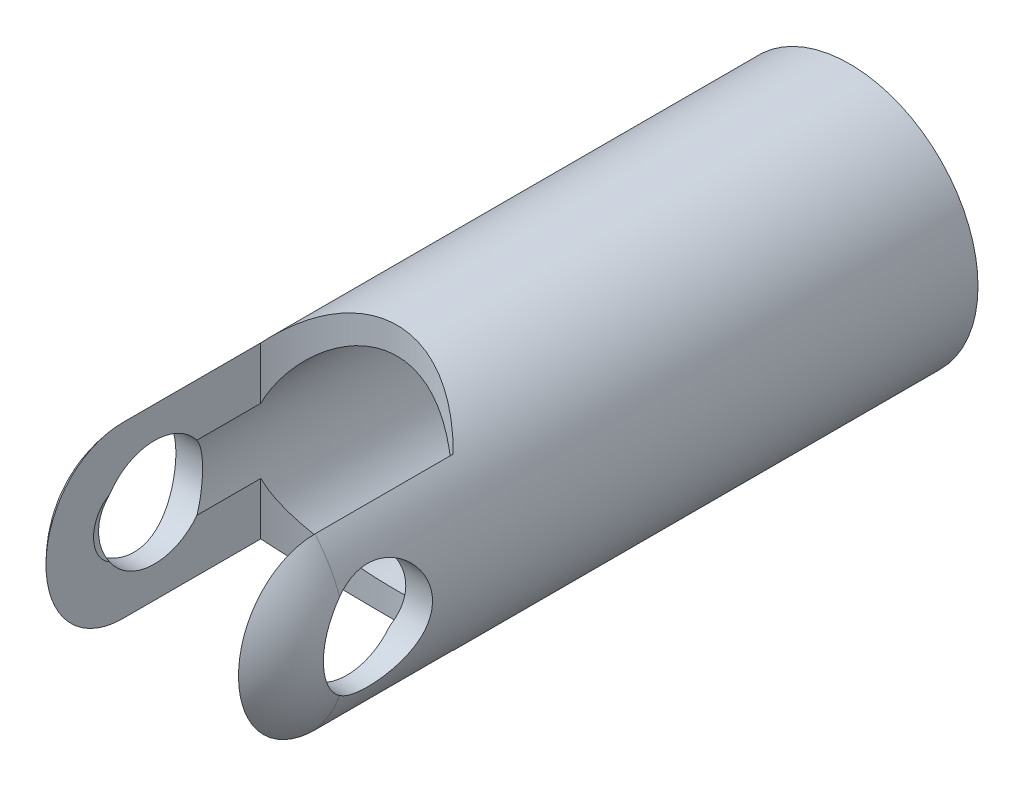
ISO-10303-21;
HEADER;
FILE_DESCRIPTION(('STEP AP214'),'2;1');
FILE_NAME('part.step','',(''),(''),'','','');
FILE_SCHEMA(('AUTOMOTIVE_DESIGN { 1 0 10303 214 1 1 1 1 }'));
ENDSEC;
DATA;
#1=APPLICATION_CONTEXT('core data for automotive mechanical design processes');
#2=APPLICATION_PROTOCOL_DEFINITION('international standard','automotive_design',2000,#1);
#3=PRODUCT_CONTEXT('',#1,'mechanical');
#4=PRODUCT('Part','Part','',(#3));
#5=PRODUCT_RELATED_PRODUCT_CATEGORY('part','',(#4));
#6=PRODUCT_DEFINITION_FORMATION('','',#4);
#7=PRODUCT_DEFINITION_CONTEXT('part definition',#1,'design');
#8=PRODUCT_DEFINITION('design','',#6,#7);
#9=PRODUCT_DEFINITION_SHAPE('','',#8);
#10=(LENGTH_UNIT() NAMED_UNIT(*) SI_UNIT(.MILLI.,.METRE.));
#11=(NAMED_UNIT(*) PLANE_ANGLE_UNIT() SI_UNIT($,.RADIAN.));
#12=(NAMED_UNIT(*) SI_UNIT($,.STERADIAN.) SOLID_ANGLE_UNIT());
#13=UNCERTAINTY_MEASURE_WITH_UNIT(LENGTH_MEASURE(1.E-05),#10,'distance_accuracy_value','');
#14=(GEOMETRIC_REPRESENTATION_CONTEXT(3) GLOBAL_UNCERTAINTY_ASSIGNED_CONTEXT((#13)) GLOBAL_UNIT_ASSIGNED_CONTEXT((#10,
#11,#12)) REPRESENTATION_CONTEXT('',''));
#15=CARTESIAN_POINT('',(0.,0.,0.));
#16=DIRECTION('',(0.,0.,1.));
#17=DIRECTION('',(1.,0.,0.));
#18=AXIS2_PLACEMENT_3D('',#15,#16,#17);
#19=CARTESIAN_POINT('',(0.,0.,34.5));
#20=DIRECTION('',(0.,0.,-1.));
#21=DIRECTION('',(-1.,0.,0.));
#22=AXIS2_PLACEMENT_3D('',#19,#20,#21);
#23=CYLINDRICAL_SURFACE('',#22,6.);
#24=CARTESIAN_POINT('',(0.,0.,0.));
#25=DIRECTION('',(0.,0.,1.));
#26=DIRECTION('',(1.,0.,0.));
#27=AXIS2_PLACEMENT_3D('',#24,#25,#26);
#28=CIRCLE('',#27,6.);
#29=CARTESIAN_POINT('',(6.,0.,0.));
#30=VERTEX_POINT('',#29);
#31=EDGE_CURVE('E288',#30,#30,#28,.T.);
#32=ORIENTED_EDGE('',*,*,#31,.T.);
#33=EDGE_LOOP('',(#32));
#34=FACE_BOUND('',#33,.T.);
#35=CARTESIAN_POINT('',(5.65685424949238,-2.,29.5));
#36=CARTESIAN_POINT('',(5.64258527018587,-2.04035756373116,29.4461831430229));
#37=CARTESIAN_POINT('',(5.62859093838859,-2.07856685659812,29.3907162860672));
#38=CARTESIAN_POINT('',(5.60150751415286,-2.15048608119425,29.2767003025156));
#39=CARTESIAN_POINT('',(5.58841875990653,-2.1841943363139,29.2181500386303));
#40=CARTESIAN_POINT('',(5.55101842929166,-2.27832746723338,29.0380580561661));
#41=CARTESIAN_POINT('',(5.52862403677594,-2.33162124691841,28.9122607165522));
#42=CARTESIAN_POINT('',(5.49170626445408,-2.41730707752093,28.652245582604));
#43=CARTESIAN_POINT('',(5.47720519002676,-2.44963994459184,28.518005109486));
#44=CARTESIAN_POINT('',(5.45819514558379,-2.49171810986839,28.2455266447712));
#45=CARTESIAN_POINT('',(5.45366771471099,-2.50150514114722,28.1072965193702));
#46=CARTESIAN_POINT('',(5.45517381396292,-2.49821268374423,27.8390306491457));
#47=CARTESIAN_POINT('',(5.46062438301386,-2.48639546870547,27.7089737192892));
#48=CARTESIAN_POINT('',(5.4802404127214,-2.44285168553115,27.4528601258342));
#49=CARTESIAN_POINT('',(5.49441135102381,-2.4111126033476,27.3268060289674));
#50=CARTESIAN_POINT('',(5.52970860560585,-2.32901178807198,27.0822129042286));
#51=CARTESIAN_POINT('',(5.55082473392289,-2.27867731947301,26.9636631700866));
#52=CARTESIAN_POINT('',(5.59770649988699,-2.16094556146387,26.7363914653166));
#53=CARTESIAN_POINT('',(5.62347308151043,-2.09354480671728,26.6276714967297));
#54=CARTESIAN_POINT('',(5.67934311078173,-1.93713582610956,26.4136595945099));
#55=CARTESIAN_POINT('',(5.70962890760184,-1.84681076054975,26.3093762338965));
#56=CARTESIAN_POINT('',(5.76954290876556,-1.65013282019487,26.1169162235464));
#57=CARTESIAN_POINT('',(5.79917084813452,-1.54377361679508,26.0287459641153));
#58=CARTESIAN_POINT('',(5.85597105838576,-1.3123934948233,25.8673115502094));
#59=CARTESIAN_POINT('',(5.88298173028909,-1.18676446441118,25.7948568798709));
#60=CARTESIAN_POINT('',(5.92996034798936,-0.92378036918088,25.6724176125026));
#61=CARTESIAN_POINT('',(5.94993148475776,-0.786430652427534,25.6224228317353));
#62=CARTESIAN_POINT('',(5.97968427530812,-0.511383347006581,25.548940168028));
#63=CARTESIAN_POINT('',(5.98993689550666,-0.374066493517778,25.5242219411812));
#64=CARTESIAN_POINT('',(6.00081839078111,-0.0968769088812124,25.4980062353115));
#65=CARTESIAN_POINT('',(6.00145116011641,0.042994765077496,25.4964993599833));
#66=CARTESIAN_POINT('',(5.99329434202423,0.312179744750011,25.516124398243));
#67=CARTESIAN_POINT('',(5.98508003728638,0.441614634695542,25.5358740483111));
#68=CARTESIAN_POINT('',(5.96095685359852,0.695136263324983,25.5950606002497));
#69=CARTESIAN_POINT('',(5.94504744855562,0.819222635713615,25.6344988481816));
#70=CARTESIAN_POINT('',(5.90678366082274,1.06069833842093,25.7323703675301));
#71=CARTESIAN_POINT('',(5.88433931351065,1.1779647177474,25.7910703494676));
#72=CARTESIAN_POINT('',(5.8351945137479,1.40128456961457,25.9255346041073));
#73=CARTESIAN_POINT('',(5.80849255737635,1.50733405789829,26.0013049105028));
#74=CARTESIAN_POINT('',(5.75129110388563,1.71314026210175,26.1739561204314));
#75=CARTESIAN_POINT('',(5.72065660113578,1.81192948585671,26.2719471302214));
#76=CARTESIAN_POINT('',(5.66044099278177,1.9920970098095,26.4831518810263));
#77=CARTESIAN_POINT('',(5.63086029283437,2.07346866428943,26.5963714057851));
#78=CARTESIAN_POINT('',(5.57512512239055,2.21907122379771,26.8396234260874));
#79=CARTESIAN_POINT('',(5.54911955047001,2.2826327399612,26.9700936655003));
#80=CARTESIAN_POINT('',(5.50525820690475,2.38649269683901,27.2412566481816));
#81=CARTESIAN_POINT('',(5.48739690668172,2.42680692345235,27.381942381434));
#82=CARTESIAN_POINT('',(5.46330908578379,2.48053869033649,27.6599099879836));
#83=CARTESIAN_POINT('',(5.45640949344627,2.49551622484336,27.7968309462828));
#84=CARTESIAN_POINT('',(5.4530987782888,2.50274639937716,28.0713708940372));
#85=CARTESIAN_POINT('',(5.45668333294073,2.49500840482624,28.2089895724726));
#86=CARTESIAN_POINT('',(5.47323721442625,2.45845932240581,28.4716221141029));
#87=CARTESIAN_POINT('',(5.48558417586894,2.43104442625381,28.5968753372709));
#88=CARTESIAN_POINT('',(5.51747392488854,2.35776674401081,28.8409311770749));
#89=CARTESIAN_POINT('',(5.53701844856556,2.31189950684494,28.9597322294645));
#90=CARTESIAN_POINT('',(5.57365511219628,2.22167951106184,29.1494101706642));
#91=CARTESIAN_POINT('',(5.58933278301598,2.18208377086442,29.2228813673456));
#92=CARTESIAN_POINT('',(5.62215606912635,2.0960604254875,29.3650680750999));
#93=CARTESIAN_POINT('',(5.6392973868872,2.04965255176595,29.4337965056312));
#94=CARTESIAN_POINT('',(5.65685424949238,2.,29.5));
#95=B_SPLINE_CURVE_WITH_KNOTS('',3,(#35,#36,#37,#38,#39,#40,#41,#42,#43,#44,#45,#46,#47,#48,#49,
#50,#51,#52,#53,#54,#55,#56,#57,#58,#59,#60,#61,#62,#63,#64,#65,#66,#67,#68,#69,#70,#71,#72,#73,
#74,#75,#76,#77,#78,#79,#80,#81,#82,#83,#84,#85,#86,#87,#88,#89,#90,#91,#92,#93,#94),
.UNSPECIFIED.,.F.,.F.,(4,2,2,2,2,2,2,2,2,2,2,2,2,2,2,2,2,2,2,2,2,2,2,2,2,2,2,2,2,4),(0.,
0.206183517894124,0.412443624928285,0.825668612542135,1.24005533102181,1.65367438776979,
2.04389435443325,2.43435968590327,2.82425477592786,3.21422909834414,3.63611597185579,
4.05816980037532,4.49847496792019,4.93858029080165,5.35606474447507,5.77338018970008,
6.16511107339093,6.5568687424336,6.95429756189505,7.35186707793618,7.77740455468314,
8.20310410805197,8.6431371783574,9.08287109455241,9.49438648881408,9.90573224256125,
10.2904570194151,10.6752746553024,10.92964798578,11.1832985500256),.UNSPECIFIED.);
#96=CARTESIAN_POINT('',(5.65685424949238,-2.,29.5));
#97=VERTEX_POINT('',#96);
#98=CARTESIAN_POINT('',(5.65685424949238,2.,29.5));
#99=VERTEX_POINT('',#98);
#100=EDGE_CURVE('E48',#97,#99,#95,.T.);
#101=ORIENTED_EDGE('',*,*,#100,.F.);
#102=CARTESIAN_POINT('',(0.,0.,29.5));
#103=DIRECTION('',(0.,0.,1.));
#104=DIRECTION('',(1.,0.,0.));
#105=AXIS2_PLACEMENT_3D('',#102,#103,#104);
#106=CIRCLE('',#105,6.);
#107=CARTESIAN_POINT('',(4.5,-3.96862696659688,29.5));
#108=VERTEX_POINT('',#107);
#109=EDGE_CURVE('E290',#97,#108,#106,.F.);
#110=ORIENTED_EDGE('',*,*,#109,.T.);
#111=DIRECTION('',(0.,0.,-1.));
#112=VECTOR('',#111,1.);
#113=CARTESIAN_POINT('',(4.5,-3.96862696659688,34.5));
#114=LINE('',#113,#112);
#115=CARTESIAN_POINT('',(4.5,-3.96862696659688,23.0313730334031));
#116=VERTEX_POINT('',#115);
#117=EDGE_CURVE('E199',#116,#108,#114,.F.);
#118=ORIENTED_EDGE('',*,*,#117,.F.);
#119=CARTESIAN_POINT('',(-4.5,-3.96862696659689,23.0313730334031));
#120=CARTESIAN_POINT('',(-4.39897282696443,-4.08315075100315,22.9296403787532));
#121=CARTESIAN_POINT('',(-4.29279529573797,-4.19475555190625,22.8296166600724));
#122=CARTESIAN_POINT('',(-4.06976615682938,-4.41149602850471,22.6340279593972));
#123=CARTESIAN_POINT('',(-3.95289731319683,-4.51662078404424,22.538470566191));
#124=CARTESIAN_POINT('',(-3.70732336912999,-4.72031704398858,22.3523490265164));
#125=CARTESIAN_POINT('',(-3.5785196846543,-4.81881972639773,22.2618386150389));
#126=CARTESIAN_POINT('',(-3.31013324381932,-5.00698613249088,22.0882332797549));
#127=CARTESIAN_POINT('',(-3.17055761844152,-5.09665561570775,22.0051335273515));
#128=CARTESIAN_POINT('',(-2.79921425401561,-5.31346141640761,21.8035871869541));
#129=CARTESIAN_POINT('',(-2.55959495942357,-5.43345379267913,21.6914110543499));
#130=CARTESIAN_POINT('',(-2.18304951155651,-5.59042006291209,21.54423796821));
#131=CARTESIAN_POINT('',(-2.0548255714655,-5.63886616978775,21.4987323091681));
#132=CARTESIAN_POINT('',(-1.79313830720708,-5.72745135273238,21.41542134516));
#133=CARTESIAN_POINT('',(-1.65967772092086,-5.76759470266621,21.3776120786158));
#134=CARTESIAN_POINT('',(-1.38694219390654,-5.8392183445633,21.3100925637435));
#135=CARTESIAN_POINT('',(-1.24762269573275,-5.87060871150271,21.2804664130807));
#136=CARTESIAN_POINT('',(-0.965476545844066,-5.92355051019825,21.2304703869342));
#137=CARTESIAN_POINT('',(-0.822649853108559,-5.94510182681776,21.2101006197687));
#138=CARTESIAN_POINT('',(-0.534748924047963,-5.97787886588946,21.1791112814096));
#139=CARTESIAN_POINT('',(-0.389674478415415,-5.98910362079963,21.1684926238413));
#140=CARTESIAN_POINT('',(-0.0987152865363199,-6.00095373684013,21.1572822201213));
#141=CARTESIAN_POINT('',(0.0471693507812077,-6.00158048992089,21.1566891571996));
#142=CARTESIAN_POINT('',(0.31854892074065,-5.99286138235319,21.1649377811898));
#143=CARTESIAN_POINT('',(0.444129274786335,-5.98485474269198,21.172512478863));
#144=CARTESIAN_POINT('',(0.693926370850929,-5.96105792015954,21.1950159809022));
#145=CARTESIAN_POINT('',(0.818142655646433,-5.94526520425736,21.2099471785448));
#146=CARTESIAN_POINT('',(1.0641880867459,-5.90618327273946,21.2468738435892));
#147=CARTESIAN_POINT('',(1.1860195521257,-5.88290176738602,21.2688620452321));
#148=CARTESIAN_POINT('',(1.42670340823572,-5.82921498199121,21.31952296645));
#149=CARTESIAN_POINT('',(1.54555464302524,-5.79880698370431,21.348198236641));
#150=CARTESIAN_POINT('',(1.89817478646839,-5.69709749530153,21.444009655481));
#151=CARTESIAN_POINT('',(2.12651593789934,-5.61555456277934,21.520700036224));
#152=CARTESIAN_POINT('',(2.56531020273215,-5.42920748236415,21.6953584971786));
#153=CARTESIAN_POINT('',(2.77571380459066,-5.32434166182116,21.7933829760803));
#154=CARTESIAN_POINT('',(3.12620198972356,-5.12413745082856,21.9796355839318));
#155=CARTESIAN_POINT('',(3.27070577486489,-5.03298400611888,22.064174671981));
#156=CARTESIAN_POINT('',(3.54834536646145,-4.84125224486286,22.2411981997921));
#157=CARTESIAN_POINT('',(3.68147115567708,-4.74066578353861,22.3336894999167));
#158=CARTESIAN_POINT('',(3.93536836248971,-4.53207688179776,22.5244041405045));
#159=CARTESIAN_POINT('',(4.0562154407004,-4.42412770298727,22.622585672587));
#160=CARTESIAN_POINT('',(4.28651625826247,-4.20134783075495,22.8237063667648));
#161=CARTESIAN_POINT('',(4.39599164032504,-4.08653089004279,22.9266359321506));
#162=CARTESIAN_POINT('',(4.5,-3.96862696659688,23.0313730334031));
#163=B_SPLINE_CURVE_WITH_KNOTS('',3,(#119,#120,#121,#122,#123,#124,#125,#126,#127,#128,#129,
#130,#131,#132,#133,#134,#135,#136,#137,#138,#139,#140,#141,#142,#143,#144,#145,#146,#147,#148,
#149,#150,#151,#152,#153,#154,#155,#156,#157,#158,#159,#160,#161,#162),.UNSPECIFIED.,.F.,.F.,(4,
2,2,2,2,2,2,2,2,2,2,2,2,2,2,2,2,2,2,2,2,4),(0.,0.550487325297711,1.10187830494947,
1.65831831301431,2.2143930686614,3.08191400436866,3.514764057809,3.94739074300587,
4.38431078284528,4.82123593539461,5.2582020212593,5.69511071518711,6.07284327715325,
6.45069880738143,6.82816654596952,7.20577849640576,7.96554475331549,8.72734446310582,
9.29846910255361,9.87009149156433,10.4379454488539,11.0046980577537),.UNSPECIFIED.);
#164=CARTESIAN_POINT('',(-4.5,-3.9686269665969,23.0313730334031));
#165=VERTEX_POINT('',#164);
#166=EDGE_CURVE('E273',#165,#116,#163,.T.);
#167=ORIENTED_EDGE('',*,*,#166,.F.);
#168=DIRECTION('',(0.,0.,-1.));
#169=VECTOR('',#168,1.);
#170=CARTESIAN_POINT('',(-4.5,-3.96862696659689,34.5));
#171=LINE('',#170,#169);
#172=CARTESIAN_POINT('',(-4.5,-3.96862696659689,29.5));
#173=VERTEX_POINT('',#172);
#174=EDGE_CURVE('E186',#173,#165,#171,.T.);
#175=ORIENTED_EDGE('',*,*,#174,.F.);
#176=CARTESIAN_POINT('',(-5.65685424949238,-2.,29.5));
#177=VERTEX_POINT('',#176);
#178=EDGE_CURVE('E139',#173,#177,#106,.F.);
#179=ORIENTED_EDGE('',*,*,#178,.T.);
#180=CARTESIAN_POINT('',(-5.65685424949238,2.,29.5));
#181=CARTESIAN_POINT('',(-5.64258527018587,2.04035756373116,29.4461831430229));
#182=CARTESIAN_POINT('',(-5.62859093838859,2.07856685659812,29.3907162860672));
#183=CARTESIAN_POINT('',(-5.60150751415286,2.15048608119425,29.2767003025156));
#184=CARTESIAN_POINT('',(-5.58841875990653,2.1841943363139,29.2181500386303));
#185=CARTESIAN_POINT('',(-5.55101842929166,2.27832746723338,29.0380580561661));
#186=CARTESIAN_POINT('',(-5.52862403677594,2.33162124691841,28.9122607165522));
#187=CARTESIAN_POINT('',(-5.49170626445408,2.41730707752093,28.652245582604));
#188=CARTESIAN_POINT('',(-5.47720519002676,2.44963994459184,28.518005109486));
#189=CARTESIAN_POINT('',(-5.45819514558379,2.49171810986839,28.2455266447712));
#190=CARTESIAN_POINT('',(-5.45366771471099,2.50150514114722,28.1072965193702));
#191=CARTESIAN_POINT('',(-5.45517381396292,2.49821268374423,27.8390306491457));
#192=CARTESIAN_POINT('',(-5.46062438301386,2.48639546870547,27.7089737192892));
#193=CARTESIAN_POINT('',(-5.4802404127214,2.44285168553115,27.4528601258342));
#194=CARTESIAN_POINT('',(-5.49441135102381,2.4111126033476,27.3268060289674));
#195=CARTESIAN_POINT('',(-5.52970860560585,2.32901178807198,27.0822129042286));
#196=CARTESIAN_POINT('',(-5.55082473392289,2.27867731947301,26.9636631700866));
#197=CARTESIAN_POINT('',(-5.59770649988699,2.16094556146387,26.7363914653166));
#198=CARTESIAN_POINT('',(-5.62347308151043,2.09354480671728,26.6276714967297));
#199=CARTESIAN_POINT('',(-5.67934311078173,1.93713582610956,26.4136595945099));
#200=CARTESIAN_POINT('',(-5.70962890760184,1.84681076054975,26.3093762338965));
#201=CARTESIAN_POINT('',(-5.76954290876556,1.65013282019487,26.1169162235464));
#202=CARTESIAN_POINT('',(-5.79917084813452,1.54377361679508,26.0287459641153));
#203=CARTESIAN_POINT('',(-5.85597105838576,1.3123934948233,25.8673115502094));
#204=CARTESIAN_POINT('',(-5.88298173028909,1.18676446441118,25.7948568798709));
#205=CARTESIAN_POINT('',(-5.92996034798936,0.92378036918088,25.6724176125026));
#206=CARTESIAN_POINT('',(-5.94993148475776,0.786430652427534,25.6224228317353));
#207=CARTESIAN_POINT('',(-5.97968427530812,0.511383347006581,25.548940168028));
#208=CARTESIAN_POINT('',(-5.98993689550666,0.374066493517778,25.5242219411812));
#209=CARTESIAN_POINT('',(-6.00081839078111,0.0968769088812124,25.4980062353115));
#210=CARTESIAN_POINT('',(-6.00145116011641,-0.042994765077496,25.4964993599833));
#211=CARTESIAN_POINT('',(-5.99329434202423,-0.312179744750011,25.516124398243));
#212=CARTESIAN_POINT('',(-5.98508003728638,-0.441614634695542,25.5358740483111));
#213=CARTESIAN_POINT('',(-5.96095685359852,-0.695136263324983,25.5950606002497));
#214=CARTESIAN_POINT('',(-5.94504744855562,-0.819222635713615,25.6344988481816));
#215=CARTESIAN_POINT('',(-5.90678366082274,-1.06069833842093,25.7323703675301));
#216=CARTESIAN_POINT('',(-5.88433931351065,-1.1779647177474,25.7910703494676));
#217=CARTESIAN_POINT('',(-5.8351945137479,-1.40128456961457,25.9255346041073));
#218=CARTESIAN_POINT('',(-5.80849255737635,-1.50733405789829,26.0013049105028));
#219=CARTESIAN_POINT('',(-5.75129110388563,-1.71314026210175,26.1739561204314));
#220=CARTESIAN_POINT('',(-5.72065660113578,-1.81192948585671,26.2719471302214));
#221=CARTESIAN_POINT('',(-5.66044099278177,-1.9920970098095,26.4831518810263));
#222=CARTESIAN_POINT('',(-5.63086029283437,-2.07346866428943,26.5963714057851));
#223=CARTESIAN_POINT('',(-5.57512512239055,-2.21907122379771,26.8396234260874));
#224=CARTESIAN_POINT('',(-5.54911955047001,-2.2826327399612,26.9700936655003));
#225=CARTESIAN_POINT('',(-5.50525820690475,-2.38649269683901,27.2412566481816));
#226=CARTESIAN_POINT('',(-5.48739690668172,-2.42680692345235,27.381942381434));
#227=CARTESIAN_POINT('',(-5.46330908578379,-2.48053869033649,27.6599099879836));
#228=CARTESIAN_POINT('',(-5.45640949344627,-2.49551622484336,27.7968309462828));
#229=CARTESIAN_POINT('',(-5.4530987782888,-2.50274639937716,28.0713708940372));
#230=CARTESIAN_POINT('',(-5.45668333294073,-2.49500840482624,28.2089895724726));
#231=CARTESIAN_POINT('',(-5.47323721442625,-2.45845932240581,28.4716221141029));
#232=CARTESIAN_POINT('',(-5.48558417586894,-2.43104442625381,28.5968753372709));
#233=CARTESIAN_POINT('',(-5.51747392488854,-2.35776674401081,28.8409311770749));
#234=CARTESIAN_POINT('',(-5.53701844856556,-2.31189950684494,28.9597322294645));
#235=CARTESIAN_POINT('',(-5.57365511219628,-2.22167951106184,29.1494101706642));
#236=CARTESIAN_POINT('',(-5.58933278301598,-2.18208377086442,29.2228813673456));
#237=CARTESIAN_POINT('',(-5.62215606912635,-2.0960604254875,29.3650680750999));
#238=CARTESIAN_POINT('',(-5.6392973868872,-2.04965255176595,29.4337965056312));
#239=CARTESIAN_POINT('',(-5.65685424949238,-2.,29.5));
#240=B_SPLINE_CURVE_WITH_KNOTS('',3,(#180,#181,#182,#183,#184,#185,#186,#187,#188,#189,#190,
#191,#192,#193,#194,#195,#196,#197,#198,#199,#200,#201,#202,#203,#204,#205,#206,#207,#208,#209,
#210,#211,#212,#213,#214,#215,#216,#217,#218,#219,#220,#221,#222,#223,#224,#225,#226,#227,#228,
#229,#230,#231,#232,#233,#234,#235,#236,#237,#238,#239),.UNSPECIFIED.,.F.,.F.,(4,2,2,2,2,2,2,2,
2,2,2,2,2,2,2,2,2,2,2,2,2,2,2,2,2,2,2,2,2,4),(0.,0.206183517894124,0.412443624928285,
0.825668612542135,1.24005533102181,1.65367438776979,2.04389435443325,2.43435968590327,
2.82425477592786,3.21422909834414,3.63611597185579,4.05816980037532,4.49847496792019,
4.93858029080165,5.35606474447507,5.77338018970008,6.16511107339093,6.5568687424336,
6.95429756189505,7.35186707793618,7.77740455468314,8.20310410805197,8.6431371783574,
9.08287109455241,9.49438648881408,9.90573224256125,10.2904570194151,10.6752746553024,
10.92964798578,11.1832985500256),.UNSPECIFIED.);
#241=CARTESIAN_POINT('',(-5.65685424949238,2.,29.5));
#242=VERTEX_POINT('',#241);
#243=EDGE_CURVE('E55',#242,#177,#240,.T.);
#244=ORIENTED_EDGE('',*,*,#243,.F.);
#245=CARTESIAN_POINT('',(-4.5,3.96862696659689,29.5));
#246=VERTEX_POINT('',#245);
#247=EDGE_CURVE('E145',#242,#246,#106,.F.);
#248=ORIENTED_EDGE('',*,*,#247,.T.);
#249=DIRECTION('',(0.,0.,-1.));
#250=VECTOR('',#249,1.);
#251=CARTESIAN_POINT('',(-4.5,3.96862696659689,34.5));
#252=LINE('',#251,#250);
#253=CARTESIAN_POINT('',(-4.5,3.96862696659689,23.0313730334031));
#254=VERTEX_POINT('',#253);
#255=EDGE_CURVE('E181',#254,#246,#252,.F.);
#256=ORIENTED_EDGE('',*,*,#255,.F.);
#257=CARTESIAN_POINT('',(4.5,3.96862696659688,23.0313730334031));
#258=CARTESIAN_POINT('',(4.39897282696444,4.08315075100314,22.9296403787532));
#259=CARTESIAN_POINT('',(4.29279529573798,4.19475555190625,22.8296166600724));
#260=CARTESIAN_POINT('',(4.06976615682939,4.41149602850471,22.6340279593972));
#261=CARTESIAN_POINT('',(3.95289731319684,4.51662078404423,22.538470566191));
#262=CARTESIAN_POINT('',(3.70732336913,4.72031704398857,22.3523490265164));
#263=CARTESIAN_POINT('',(3.57851968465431,4.81881972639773,22.2618386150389));
#264=CARTESIAN_POINT('',(3.31013324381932,5.00698613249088,22.0882332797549));
#265=CARTESIAN_POINT('',(3.17055761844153,5.09665561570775,22.0051335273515));
#266=CARTESIAN_POINT('',(2.79921425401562,5.31346141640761,21.8035871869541));
#267=CARTESIAN_POINT('',(2.55959495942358,5.43345379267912,21.6914110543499));
#268=CARTESIAN_POINT('',(2.18304951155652,5.59042006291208,21.54423796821));
#269=CARTESIAN_POINT('',(2.05482557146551,5.63886616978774,21.4987323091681));
#270=CARTESIAN_POINT('',(1.79313830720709,5.72745135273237,21.41542134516));
#271=CARTESIAN_POINT('',(1.65967772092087,5.76759470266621,21.3776120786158));
#272=CARTESIAN_POINT('',(1.38694219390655,5.8392183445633,21.3100925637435));
#273=CARTESIAN_POINT('',(1.24762269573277,5.87060871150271,21.2804664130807));
#274=CARTESIAN_POINT('',(0.965476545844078,5.92355051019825,21.2304703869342));
#275=CARTESIAN_POINT('',(0.82264985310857,5.94510182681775,21.2101006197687));
#276=CARTESIAN_POINT('',(0.534748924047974,5.97787886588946,21.1791112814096));
#277=CARTESIAN_POINT('',(0.389674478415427,5.98910362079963,21.1684926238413));
#278=CARTESIAN_POINT('',(0.0987152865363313,6.00095373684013,21.1572822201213));
#279=CARTESIAN_POINT('',(-0.0471693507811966,6.00158048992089,21.1566891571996));
#280=CARTESIAN_POINT('',(-0.318548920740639,5.99286138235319,21.1649377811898));
#281=CARTESIAN_POINT('',(-0.444129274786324,5.98485474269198,21.172512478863));
#282=CARTESIAN_POINT('',(-0.693926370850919,5.96105792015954,21.1950159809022));
#283=CARTESIAN_POINT('',(-0.818142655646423,5.94526520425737,21.2099471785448));
#284=CARTESIAN_POINT('',(-1.06418808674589,5.90618327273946,21.2468738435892));
#285=CARTESIAN_POINT('',(-1.18601955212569,5.88290176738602,21.2688620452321));
#286=CARTESIAN_POINT('',(-1.42670340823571,5.82921498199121,21.31952296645));
#287=CARTESIAN_POINT('',(-1.54555464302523,5.79880698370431,21.3481982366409));
#288=CARTESIAN_POINT('',(-1.89817478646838,5.69709749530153,21.444009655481));
#289=CARTESIAN_POINT('',(-2.12651593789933,5.61555456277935,21.520700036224));
#290=CARTESIAN_POINT('',(-2.56531020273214,5.42920748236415,21.6953584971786));
#291=CARTESIAN_POINT('',(-2.77571380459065,5.32434166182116,21.7933829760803));
#292=CARTESIAN_POINT('',(-3.12620198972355,5.12413745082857,21.9796355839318));
#293=CARTESIAN_POINT('',(-3.27070577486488,5.03298400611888,22.064174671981));
#294=CARTESIAN_POINT('',(-3.54834536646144,4.84125224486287,22.2411981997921));
#295=CARTESIAN_POINT('',(-3.68147115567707,4.74066578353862,22.3336894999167));
#296=CARTESIAN_POINT('',(-3.9353683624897,4.53207688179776,22.5244041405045));
#297=CARTESIAN_POINT('',(-4.05621544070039,4.42412770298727,22.622585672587));
#298=CARTESIAN_POINT('',(-4.28651625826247,4.20134783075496,22.8237063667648));
#299=CARTESIAN_POINT('',(-4.39599164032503,4.0865308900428,22.9266359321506));
#300=CARTESIAN_POINT('',(-4.5,3.96862696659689,23.0313730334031));
#301=B_SPLINE_CURVE_WITH_KNOTS('',3,(#257,#258,#259,#260,#261,#262,#263,#264,#265,#266,#267,
#268,#269,#270,#271,#272,#273,#274,#275,#276,#277,#278,#279,#280,#281,#282,#283,#284,#285,#286,
#287,#288,#289,#290,#291,#292,#293,#294,#295,#296,#297,#298,#299,#300),.UNSPECIFIED.,.F.,.F.,(4,
2,2,2,2,2,2,2,2,2,2,2,2,2,2,2,2,2,2,2,2,4),(0.,0.550487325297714,1.10187830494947,
1.65831831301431,2.21439306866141,3.08191400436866,3.514764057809,3.94739074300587,
4.38431078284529,4.82123593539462,5.2582020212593,5.69511071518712,6.07284327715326,
6.45069880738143,6.82816654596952,7.20577849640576,7.9655447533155,8.72734446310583,
9.29846910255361,9.87009149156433,10.4379454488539,11.0046980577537),.UNSPECIFIED.);
#302=CARTESIAN_POINT('',(4.5,3.96862696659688,23.0313730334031));
#303=VERTEX_POINT('',#302);
#304=EDGE_CURVE('E280',#303,#254,#301,.T.);
#305=ORIENTED_EDGE('',*,*,#304,.F.);
#306=DIRECTION('',(0.,0.,-1.));
#307=VECTOR('',#306,1.);
#308=CARTESIAN_POINT('',(4.5,3.96862696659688,34.5));
#309=LINE('',#308,#307);
#310=CARTESIAN_POINT('',(4.5,3.96862696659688,29.5));
#311=VERTEX_POINT('',#310);
#312=EDGE_CURVE('E330',#311,#303,#309,.T.);
#313=ORIENTED_EDGE('',*,*,#312,.F.);
#314=EDGE_CURVE('E147',#311,#99,#106,.F.);
#315=ORIENTED_EDGE('',*,*,#314,.T.);
#316=EDGE_LOOP('',(#101,#110,#118,#167,#175,#179,#244,#248,#256,#305,#313,#315));
#317=FACE_BOUND('',#316,.T.);
#318=ADVANCED_FACE('F33',(#34,#317),#23,.T.);
#319=CARTESIAN_POINT('',(0.,0.,29.5));
#320=DIRECTION('',(0.,0.,1.));
#321=DIRECTION('',(1.,0.,0.));
#322=AXIS2_PLACEMENT_3D('',#319,#320,#321);
#323=DEGENERATE_TOROIDAL_SURFACE('',#322,1.,5.,.T.);
#324=ORIENTED_EDGE('',*,*,#109,.F.);
#325=CARTESIAN_POINT('',(5.65680121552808,-2.00014998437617,29.4998));
#326=CARTESIAN_POINT('',(5.67136044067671,-1.95899081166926,29.5547028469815));
#327=CARTESIAN_POINT('',(5.68527994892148,-1.91547750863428,29.6080110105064));
#328=CARTESIAN_POINT('',(5.71182267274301,-1.82402695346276,29.7110410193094));
#329=CARTESIAN_POINT('',(5.72444579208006,-1.77608937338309,29.7607625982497));
#330=CARTESIAN_POINT('',(5.74837622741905,-1.67608280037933,29.8562122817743));
#331=CARTESIAN_POINT('',(5.75968359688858,-1.62401397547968,29.9019405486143));
#332=CARTESIAN_POINT('',(5.78097080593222,-1.5161133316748,29.9890234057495));
#333=CARTESIAN_POINT('',(5.79095070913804,-1.46028169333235,30.0303782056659));
#334=CARTESIAN_POINT('',(5.81891218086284,-1.28755270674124,30.1474445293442));
#335=CARTESIAN_POINT('',(5.83491087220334,-1.16544091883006,30.2161392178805));
#336=CARTESIAN_POINT('',(5.86158466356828,-0.911098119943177,30.3322655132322));
#337=CARTESIAN_POINT('',(5.87226234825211,-0.77887205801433,30.3797074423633));
#338=CARTESIAN_POINT('',(5.88826669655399,-0.509903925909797,30.4513442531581));
#339=CARTESIAN_POINT('',(5.89366524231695,-0.373249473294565,30.475851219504));
#340=CARTESIAN_POINT('',(5.89940639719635,-0.0976376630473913,30.5019259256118));
#341=CARTESIAN_POINT('',(5.89974802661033,0.0413201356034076,30.5034892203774));
#342=CARTESIAN_POINT('',(5.89539398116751,0.31643086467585,30.4836958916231));
#343=CARTESIAN_POINT('',(5.89073711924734,0.452597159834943,30.4625158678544));
#344=CARTESIAN_POINT('',(5.87640895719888,0.719354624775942,30.3981969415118));
#345=CARTESIAN_POINT('',(5.86673805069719,0.849946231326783,30.3550597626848));
#346=CARTESIAN_POINT('',(5.84230917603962,1.10212412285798,30.248137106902));
#347=CARTESIAN_POINT('',(5.82754228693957,1.22369415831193,30.1843154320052));
#348=CARTESIAN_POINT('',(5.79288714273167,1.4542535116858,30.0380768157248));
#349=CARTESIAN_POINT('',(5.77300087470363,1.56324768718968,29.9556670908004));
#350=CARTESIAN_POINT('',(5.73683243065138,1.72663342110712,29.8098876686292));
#351=CARTESIAN_POINT('',(5.72212232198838,1.78586120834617,29.7514482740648));
#352=CARTESIAN_POINT('',(5.69084900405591,1.8978929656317,29.629373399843));
#353=CARTESIAN_POINT('',(5.67428944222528,1.95070916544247,29.5657482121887));
#354=CARTESIAN_POINT('',(5.65680121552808,2.00014998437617,29.4998));
#355=B_SPLINE_CURVE_WITH_KNOTS('',3,(#325,#326,#327,#328,#329,#330,#331,#332,#333,#334,#335,
#336,#337,#338,#339,#340,#341,#342,#343,#344,#345,#346,#347,#348,#349,#350,#351,#352,#353,#354),
.UNSPECIFIED.,.F.,.F.,(4,2,2,2,2,2,2,2,2,2,2,2,2,2,4),(0.,0.21037573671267,0.420767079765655,
0.631149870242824,0.841522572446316,1.26234956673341,1.68297194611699,2.09778378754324,
2.51267599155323,2.92436973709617,3.3360311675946,3.74841693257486,4.16064287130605,
4.41374003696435,4.66634658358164),.UNSPECIFIED.);
#356=EDGE_CURVE('E260',#97,#99,#355,.T.);
#357=ORIENTED_EDGE('',*,*,#356,.T.);
#358=ORIENTED_EDGE('',*,*,#314,.F.);
#359=CARTESIAN_POINT('',(4.5,0.,33.0707142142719));
#360=CARTESIAN_POINT('',(4.5,-0.221750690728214,33.0707137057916));
#361=CARTESIAN_POINT('',(4.5,-0.443601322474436,33.0546592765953));
#362=CARTESIAN_POINT('',(4.5,-0.882815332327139,32.9901609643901));
#363=CARTESIAN_POINT('',(4.5,-1.10017244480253,32.9416746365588));
#364=CARTESIAN_POINT('',(4.5,-1.55496064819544,32.8025807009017));
#365=CARTESIAN_POINT('',(4.5,-1.79090851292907,32.7070032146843));
#366=CARTESIAN_POINT('',(4.5,-2.2406278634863,32.4730895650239));
#367=CARTESIAN_POINT('',(4.5,-2.45441449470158,32.3347828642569));
#368=CARTESIAN_POINT('',(4.5,-2.82935726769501,32.0343826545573));
#369=CARTESIAN_POINT('',(4.5,-2.99367132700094,31.8762376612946));
#370=CARTESIAN_POINT('',(4.5,-3.28927879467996,31.5316035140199));
#371=CARTESIAN_POINT('',(4.5,-3.42059703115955,31.3451358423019));
#372=CARTESIAN_POINT('',(4.5,-3.63155591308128,30.971960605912));
#373=CARTESIAN_POINT('',(4.5,-3.71531154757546,30.7875711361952));
#374=CARTESIAN_POINT('',(4.5,-3.84841494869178,30.4067702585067));
#375=CARTESIAN_POINT('',(4.5,-3.89777734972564,30.2103640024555));
#376=CARTESIAN_POINT('',(4.5,-3.95817036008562,29.8239161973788));
#377=CARTESIAN_POINT('',(4.5,-3.97133271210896,29.6342049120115));
#378=CARTESIAN_POINT('',(4.5,-3.96499897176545,29.2553439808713));
#379=CARTESIAN_POINT('',(4.5,-3.94550831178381,29.0661942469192));
#380=CARTESIAN_POINT('',(4.5,-3.87523206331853,28.6972599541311));
#381=CARTESIAN_POINT('',(4.5,-3.82499931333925,28.5173694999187));
#382=CARTESIAN_POINT('',(4.5,-3.69552832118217,28.1683767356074));
#383=CARTESIAN_POINT('',(4.5,-3.61628961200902,27.9992745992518));
#384=CARTESIAN_POINT('',(4.5,-3.42996872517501,27.6733987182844));
#385=CARTESIAN_POINT('',(4.5,-3.32243824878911,27.5168818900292));
#386=CARTESIAN_POINT('',(4.5,-3.08383022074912,27.2230171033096));
#387=CARTESIAN_POINT('',(4.5,-2.95274883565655,27.0856722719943));
#388=CARTESIAN_POINT('',(4.5,-2.66376868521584,26.8261293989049));
#389=CARTESIAN_POINT('',(4.5,-2.50482842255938,26.7050935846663));
#390=CARTESIAN_POINT('',(4.5,-2.17031261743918,26.4888387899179));
#391=CARTESIAN_POINT('',(4.5,-1.99473173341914,26.3936281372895));
#392=CARTESIAN_POINT('',(4.5,-1.61500088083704,26.2221901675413));
#393=CARTESIAN_POINT('',(4.5,-1.40970731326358,26.1485016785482));
#394=CARTESIAN_POINT('',(4.5,-0.990416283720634,26.0325868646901));
#395=CARTESIAN_POINT('',(4.5,-0.776413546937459,25.9903799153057));
#396=CARTESIAN_POINT('',(4.5,-0.319314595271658,25.9339072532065));
#397=CARTESIAN_POINT('',(4.5,-0.075739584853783,25.9234805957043));
#398=CARTESIAN_POINT('',(4.5,0.410115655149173,25.9411826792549));
#399=CARTESIAN_POINT('',(4.5,0.652395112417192,25.9693322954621));
#400=CARTESIAN_POINT('',(4.5,1.14269964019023,26.0674158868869));
#401=CARTESIAN_POINT('',(4.5,1.39028277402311,26.1396085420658));
#402=CARTESIAN_POINT('',(4.5,1.86807981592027,26.3281815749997));
#403=CARTESIAN_POINT('',(4.5,2.09830492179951,26.4445331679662));
#404=CARTESIAN_POINT('',(4.5,2.51392062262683,26.7091236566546));
#405=CARTESIAN_POINT('',(4.5,2.7014321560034,26.8540173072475));
#406=CARTESIAN_POINT('',(4.5,3.0451588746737,27.1771427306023));
#407=CARTESIAN_POINT('',(4.5,3.20139958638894,27.3553470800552));
#408=CARTESIAN_POINT('',(4.5,3.45848555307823,27.7163791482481));
#409=CARTESIAN_POINT('',(4.5,3.56372941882,27.8960832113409));
#410=CARTESIAN_POINT('',(4.5,3.73972377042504,28.2716563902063));
#411=CARTESIAN_POINT('',(4.5,3.81049178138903,28.4675172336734));
#412=CARTESIAN_POINT('',(4.5,3.91059294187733,28.8539160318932));
#413=CARTESIAN_POINT('',(4.5,3.9426265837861,29.0437585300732));
#414=CARTESIAN_POINT('',(4.5,3.97335166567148,29.4261087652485));
#415=CARTESIAN_POINT('',(4.5,3.97205095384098,29.6186158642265));
#416=CARTESIAN_POINT('',(4.5,3.93667817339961,29.9950930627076));
#417=CARTESIAN_POINT('',(4.5,3.90352959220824,30.1791509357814));
#418=CARTESIAN_POINT('',(4.5,3.80701698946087,30.5391445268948));
#419=CARTESIAN_POINT('',(4.5,3.74365353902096,30.7150803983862));
#420=CARTESIAN_POINT('',(4.5,3.58836040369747,31.0554380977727));
#421=CARTESIAN_POINT('',(4.5,3.49621773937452,31.219762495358));
#422=CARTESIAN_POINT('',(4.5,3.28669802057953,31.5313939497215));
#423=CARTESIAN_POINT('',(4.5,3.16931895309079,31.6786996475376));
#424=CARTESIAN_POINT('',(4.5,2.90773646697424,31.9589503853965));
#425=CARTESIAN_POINT('',(4.5,2.76261782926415,32.0910392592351));
#426=CARTESIAN_POINT('',(4.5,2.4536680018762,32.3311288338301));
#427=CARTESIAN_POINT('',(4.5,2.28982819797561,32.439118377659));
#428=CARTESIAN_POINT('',(4.5,1.93426927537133,32.6374881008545));
#429=CARTESIAN_POINT('',(4.5,1.74136716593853,32.7257405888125));
#430=CARTESIAN_POINT('',(4.5,1.34463803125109,32.8722964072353));
#431=CARTESIAN_POINT('',(4.5,1.14081390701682,32.9306076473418));
#432=CARTESIAN_POINT('',(4.5,0.780517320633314,33.0063985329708));
#433=CARTESIAN_POINT('',(4.5,0.625398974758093,33.0305319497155));
#434=CARTESIAN_POINT('',(4.5,0.313536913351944,33.0626887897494));
#435=CARTESIAN_POINT('',(4.5,0.156793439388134,33.0707145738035));
#436=CARTESIAN_POINT('',(4.5,0.,33.0707142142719));
#437=B_SPLINE_CURVE_WITH_KNOTS('',3,(#359,#360,#361,#362,#363,#364,#365,#366,#367,#368,#369,
#370,#371,#372,#373,#374,#375,#376,#377,#378,#379,#380,#381,#382,#383,#384,#385,#386,#387,#388,
#389,#390,#391,#392,#393,#394,#395,#396,#397,#398,#399,#400,#401,#402,#403,#404,#405,#406,#407,
#408,#409,#410,#411,#412,#413,#414,#415,#416,#417,#418,#419,#420,#421,#422,#423,#424,#425,#426,
#427,#428,#429,#430,#431,#432,#433,#434,#435,#436),.UNSPECIFIED.,.T.,.F.,(4,2,2,2,2,2,2,2,2,2,2,
2,2,2,2,2,2,2,2,2,2,2,2,2,2,2,2,2,2,2,2,2,2,2,2,2,2,2,4),(0.,0.664820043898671,1.33051186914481,
2.08994306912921,2.84885178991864,3.52914101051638,4.20891679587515,4.81333551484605,
5.41749689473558,5.98523066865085,6.55286999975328,7.11058969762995,7.66831837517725,
8.23548098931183,8.80273600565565,9.39955019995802,9.99655662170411,10.6482665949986,
11.3003773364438,12.0286498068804,12.7573165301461,13.5269212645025,14.2960251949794,
15.0028470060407,15.7090894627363,16.3305424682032,16.9516792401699,17.526413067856,
18.1010115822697,18.6594361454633,19.2178501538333,19.780498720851,20.3431921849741,
20.9293748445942,21.5158283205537,22.1496643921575,22.783332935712,23.2534766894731,
23.7235515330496),.UNSPECIFIED.);
#438=EDGE_CURVE('E193',#311,#108,#437,.T.);
#439=ORIENTED_EDGE('',*,*,#438,.T.);
#440=EDGE_LOOP('',(#324,#357,#358,#439));
#441=FACE_BOUND('',#440,.T.);
#442=ADVANCED_FACE('F35',(#441),#323,.T.);
#443=ORIENTED_EDGE('',*,*,#247,.F.);
#444=CARTESIAN_POINT('',(-5.65680121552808,2.00014998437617,29.4998));
#445=CARTESIAN_POINT('',(-5.67136044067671,1.95899081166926,29.5547028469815));
#446=CARTESIAN_POINT('',(-5.68527994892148,1.91547750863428,29.6080110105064));
#447=CARTESIAN_POINT('',(-5.71182267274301,1.82402695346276,29.7110410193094));
#448=CARTESIAN_POINT('',(-5.72444579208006,1.77608937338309,29.7607625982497));
#449=CARTESIAN_POINT('',(-5.74837622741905,1.67608280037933,29.8562122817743));
#450=CARTESIAN_POINT('',(-5.75968359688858,1.62401397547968,29.9019405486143));
#451=CARTESIAN_POINT('',(-5.78097080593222,1.5161133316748,29.9890234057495));
#452=CARTESIAN_POINT('',(-5.79095070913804,1.46028169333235,30.0303782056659));
#453=CARTESIAN_POINT('',(-5.81891218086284,1.28755270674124,30.1474445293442));
#454=CARTESIAN_POINT('',(-5.83491087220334,1.16544091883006,30.2161392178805));
#455=CARTESIAN_POINT('',(-5.86158466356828,0.911098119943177,30.3322655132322));
#456=CARTESIAN_POINT('',(-5.87226234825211,0.77887205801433,30.3797074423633));
#457=CARTESIAN_POINT('',(-5.88826669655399,0.509903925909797,30.4513442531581));
#458=CARTESIAN_POINT('',(-5.89366524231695,0.373249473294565,30.475851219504));
#459=CARTESIAN_POINT('',(-5.89940639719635,0.0976376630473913,30.5019259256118));
#460=CARTESIAN_POINT('',(-5.89974802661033,-0.0413201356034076,30.5034892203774));
#461=CARTESIAN_POINT('',(-5.89539398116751,-0.31643086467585,30.4836958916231));
#462=CARTESIAN_POINT('',(-5.89073711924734,-0.452597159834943,30.4625158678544));
#463=CARTESIAN_POINT('',(-5.87640895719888,-0.719354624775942,30.3981969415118));
#464=CARTESIAN_POINT('',(-5.86673805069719,-0.849946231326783,30.3550597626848));
#465=CARTESIAN_POINT('',(-5.84230917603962,-1.10212412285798,30.248137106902));
#466=CARTESIAN_POINT('',(-5.82754228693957,-1.22369415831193,30.1843154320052));
#467=CARTESIAN_POINT('',(-5.79288714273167,-1.4542535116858,30.0380768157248));
#468=CARTESIAN_POINT('',(-5.77300087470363,-1.56324768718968,29.9556670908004));
#469=CARTESIAN_POINT('',(-5.73683243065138,-1.72663342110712,29.8098876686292));
#470=CARTESIAN_POINT('',(-5.72212232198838,-1.78586120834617,29.7514482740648));
#471=CARTESIAN_POINT('',(-5.69084900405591,-1.8978929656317,29.629373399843));
#472=CARTESIAN_POINT('',(-5.67428944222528,-1.95070916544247,29.5657482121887));
#473=CARTESIAN_POINT('',(-5.65680121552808,-2.00014998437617,29.4998));
#474=B_SPLINE_CURVE_WITH_KNOTS('',3,(#444,#445,#446,#447,#448,#449,#450,#451,#452,#453,#454,
#455,#456,#457,#458,#459,#460,#461,#462,#463,#464,#465,#466,#467,#468,#469,#470,#471,#472,#473),
.UNSPECIFIED.,.F.,.F.,(4,2,2,2,2,2,2,2,2,2,2,2,2,2,4),(0.,0.21037573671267,0.420767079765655,
0.631149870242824,0.841522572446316,1.26234956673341,1.68297194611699,2.09778378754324,
2.51267599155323,2.92436973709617,3.3360311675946,3.74841693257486,4.16064287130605,
4.41374003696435,4.66634658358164),.UNSPECIFIED.);
#475=EDGE_CURVE('E249',#242,#177,#474,.T.);
#476=ORIENTED_EDGE('',*,*,#475,.T.);
#477=ORIENTED_EDGE('',*,*,#178,.F.);
#478=CARTESIAN_POINT('',(-4.5,0.,33.070714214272));
#479=CARTESIAN_POINT('',(-4.5,0.221750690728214,33.0707137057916));
#480=CARTESIAN_POINT('',(-4.5,0.443601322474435,33.0546592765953));
#481=CARTESIAN_POINT('',(-4.5,0.882815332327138,32.9901609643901));
#482=CARTESIAN_POINT('',(-4.5,1.10017244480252,32.9416746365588));
#483=CARTESIAN_POINT('',(-4.5,1.55496064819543,32.8025807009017));
#484=CARTESIAN_POINT('',(-4.5,1.79090851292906,32.7070032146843));
#485=CARTESIAN_POINT('',(-4.5,2.24062786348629,32.4730895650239));
#486=CARTESIAN_POINT('',(-4.5,2.45441449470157,32.3347828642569));
#487=CARTESIAN_POINT('',(-4.5,2.82935726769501,32.0343826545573));
#488=CARTESIAN_POINT('',(-4.5,2.99367132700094,31.8762376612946));
#489=CARTESIAN_POINT('',(-4.5,3.28927879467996,31.5316035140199));
#490=CARTESIAN_POINT('',(-4.5,3.42059703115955,31.345135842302));
#491=CARTESIAN_POINT('',(-4.5,3.63155591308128,30.971960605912));
#492=CARTESIAN_POINT('',(-4.5,3.71531154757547,30.7875711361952));
#493=CARTESIAN_POINT('',(-4.5,3.84841494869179,30.4067702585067));
#494=CARTESIAN_POINT('',(-4.5,3.89777734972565,30.2103640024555));
#495=CARTESIAN_POINT('',(-4.5,3.95817036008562,29.8239161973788));
#496=CARTESIAN_POINT('',(-4.5,3.97133271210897,29.6342049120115));
#497=CARTESIAN_POINT('',(-4.5,3.96499897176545,29.2553439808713));
#498=CARTESIAN_POINT('',(-4.5,3.94550831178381,29.0661942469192));
#499=CARTESIAN_POINT('',(-4.5,3.87523206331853,28.6972599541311));
#500=CARTESIAN_POINT('',(-4.5,3.82499931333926,28.5173694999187));
#501=CARTESIAN_POINT('',(-4.5,3.69552832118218,28.1683767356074));
#502=CARTESIAN_POINT('',(-4.5,3.61628961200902,27.9992745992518));
#503=CARTESIAN_POINT('',(-4.5,3.42996872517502,27.6733987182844));
#504=CARTESIAN_POINT('',(-4.5,3.32243824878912,27.5168818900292));
#505=CARTESIAN_POINT('',(-4.5,3.08383022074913,27.2230171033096));
#506=CARTESIAN_POINT('',(-4.5,2.95274883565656,27.0856722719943));
#507=CARTESIAN_POINT('',(-4.5,2.66376868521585,26.8261293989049));
#508=CARTESIAN_POINT('',(-4.5,2.50482842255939,26.7050935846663));
#509=CARTESIAN_POINT('',(-4.5,2.17031261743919,26.4888387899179));
#510=CARTESIAN_POINT('',(-4.5,1.99473173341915,26.3936281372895));
#511=CARTESIAN_POINT('',(-4.5,1.61500088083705,26.2221901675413));
#512=CARTESIAN_POINT('',(-4.5,1.40970731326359,26.1485016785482));
#513=CARTESIAN_POINT('',(-4.5,0.990416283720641,26.0325868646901));
#514=CARTESIAN_POINT('',(-4.5,0.776413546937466,25.9903799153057));
#515=CARTESIAN_POINT('',(-4.5,0.319314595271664,25.9339072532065));
#516=CARTESIAN_POINT('',(-4.5,0.0757395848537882,25.9234805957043));
#517=CARTESIAN_POINT('',(-4.5,-0.410115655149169,25.9411826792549));
#518=CARTESIAN_POINT('',(-4.5,-0.652395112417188,25.9693322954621));
#519=CARTESIAN_POINT('',(-4.5,-1.14269964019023,26.0674158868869));
#520=CARTESIAN_POINT('',(-4.5,-1.39028277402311,26.1396085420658));
#521=CARTESIAN_POINT('',(-4.5,-1.86807981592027,26.3281815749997));
#522=CARTESIAN_POINT('',(-4.5,-2.09830492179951,26.4445331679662));
#523=CARTESIAN_POINT('',(-4.5,-2.51392062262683,26.7091236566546));
#524=CARTESIAN_POINT('',(-4.5,-2.7014321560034,26.8540173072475));
#525=CARTESIAN_POINT('',(-4.5,-3.0451588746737,27.1771427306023));
#526=CARTESIAN_POINT('',(-4.5,-3.20139958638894,27.3553470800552));
#527=CARTESIAN_POINT('',(-4.5,-3.45848555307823,27.7163791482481));
#528=CARTESIAN_POINT('',(-4.5,-3.56372941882,27.8960832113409));
#529=CARTESIAN_POINT('',(-4.5,-3.73972377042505,28.2716563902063));
#530=CARTESIAN_POINT('',(-4.5,-3.81049178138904,28.4675172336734));
#531=CARTESIAN_POINT('',(-4.5,-3.91059294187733,28.8539160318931));
#532=CARTESIAN_POINT('',(-4.5,-3.9426265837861,29.0437585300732));
#533=CARTESIAN_POINT('',(-4.5,-3.97335166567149,29.4261087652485));
#534=CARTESIAN_POINT('',(-4.5,-3.97205095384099,29.6186158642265));
#535=CARTESIAN_POINT('',(-4.5,-3.93667817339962,29.9950930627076));
#536=CARTESIAN_POINT('',(-4.5,-3.90352959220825,30.1791509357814));
#537=CARTESIAN_POINT('',(-4.5,-3.80701698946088,30.5391445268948));
#538=CARTESIAN_POINT('',(-4.5,-3.74365353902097,30.7150803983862));
#539=CARTESIAN_POINT('',(-4.5,-3.58836040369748,31.0554380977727));
#540=CARTESIAN_POINT('',(-4.5,-3.49621773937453,31.219762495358));
#541=CARTESIAN_POINT('',(-4.5,-3.28669802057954,31.5313939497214));
#542=CARTESIAN_POINT('',(-4.5,-3.16931895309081,31.6786996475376));
#543=CARTESIAN_POINT('',(-4.5,-2.90773646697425,31.9589503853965));
#544=CARTESIAN_POINT('',(-4.5,-2.76261782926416,32.0910392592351));
#545=CARTESIAN_POINT('',(-4.5,-2.45366800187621,32.3311288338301));
#546=CARTESIAN_POINT('',(-4.5,-2.28982819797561,32.439118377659));
#547=CARTESIAN_POINT('',(-4.5,-1.93426927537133,32.6374881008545));
#548=CARTESIAN_POINT('',(-4.5,-1.74136716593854,32.7257405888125));
#549=CARTESIAN_POINT('',(-4.5,-1.3446380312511,32.8722964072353));
#550=CARTESIAN_POINT('',(-4.5,-1.14081390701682,32.9306076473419));
#551=CARTESIAN_POINT('',(-4.5,-0.78051732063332,33.0063985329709));
#552=CARTESIAN_POINT('',(-4.5,-0.625398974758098,33.0305319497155));
#553=CARTESIAN_POINT('',(-4.5,-0.313536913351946,33.0626887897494));
#554=CARTESIAN_POINT('',(-4.5,-0.156793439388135,33.0707145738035));
#555=CARTESIAN_POINT('',(-4.5,0.,33.070714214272));
#556=B_SPLINE_CURVE_WITH_KNOTS('',3,(#478,#479,#480,#481,#482,#483,#484,#485,#486,#487,#488,
#489,#490,#491,#492,#493,#494,#495,#496,#497,#498,#499,#500,#501,#502,#503,#504,#505,#506,#507,
#508,#509,#510,#511,#512,#513,#514,#515,#516,#517,#518,#519,#520,#521,#522,#523,#524,#525,#526,
#527,#528,#529,#530,#531,#532,#533,#534,#535,#536,#537,#538,#539,#540,#541,#542,#543,#544,#545,
#546,#547,#548,#549,#550,#551,#552,#553,#554,#555),.UNSPECIFIED.,.T.,.F.,(4,2,2,2,2,2,2,2,2,2,2,
2,2,2,2,2,2,2,2,2,2,2,2,2,2,2,2,2,2,2,2,2,2,2,2,2,2,2,4),(0.,0.66482004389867,1.3305118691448,
2.08994306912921,2.84885178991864,3.52914101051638,4.20891679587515,4.81333551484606,
5.41749689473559,5.98523066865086,6.55286999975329,7.11058969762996,7.66831837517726,
8.23548098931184,8.80273600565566,9.39955019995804,9.99655662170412,10.6482665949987,
11.3003773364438,12.0286498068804,12.7573165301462,13.5269212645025,14.2960251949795,
15.0028470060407,15.7090894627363,16.3305424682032,16.9516792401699,17.526413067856,
18.1010115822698,18.6594361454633,19.2178501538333,19.7804987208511,20.3431921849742,
20.9293748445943,21.5158283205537,22.1496643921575,22.783332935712,23.2534766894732,
23.7235515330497),.UNSPECIFIED.);
#557=EDGE_CURVE('E174',#173,#246,#556,.T.);
#558=ORIENTED_EDGE('',*,*,#557,.T.);
#559=EDGE_LOOP('',(#443,#476,#477,#558));
#560=FACE_BOUND('',#559,.T.);
#561=ADVANCED_FACE('F209',(#560),#323,.T.);
#562=CARTESIAN_POINT('',(0.,0.,34.5));
#563=DIRECTION('',(0.,0.,-1.));
#564=DIRECTION('',(-1.,0.,0.));
#565=AXIS2_PLACEMENT_3D('',#562,#563,#564);
#566=CYLINDRICAL_SURFACE('',#565,4.75);
#567=CARTESIAN_POINT('',(0.,0.,0.));
#568=DIRECTION('',(0.,0.,1.));
#569=DIRECTION('',(1.,0.,0.));
#570=AXIS2_PLACEMENT_3D('',#567,#568,#569);
#571=CIRCLE('',#570,4.75);
#572=CARTESIAN_POINT('',(4.75,0.,0.));
#573=VERTEX_POINT('',#572);
#574=EDGE_CURVE('E286',#573,#573,#571,.T.);
#575=ORIENTED_EDGE('',*,*,#574,.F.);
#576=EDGE_LOOP('',(#575));
#577=FACE_BOUND('',#576,.T.);
#578=DIRECTION('',(0.,0.,-1.));
#579=VECTOR('',#578,1.);
#580=CARTESIAN_POINT('',(4.5,-1.52069063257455,34.5));
#581=LINE('',#580,#579);
#582=CARTESIAN_POINT('',(4.5,-1.52069063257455,23.0313730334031));
#583=VERTEX_POINT('',#582);
#584=CARTESIAN_POINT('',(4.5,-1.52069063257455,26.0156865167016));
#585=VERTEX_POINT('',#584);
#586=EDGE_CURVE('E188',#583,#585,#581,.F.);
#587=ORIENTED_EDGE('',*,*,#586,.T.);
#588=CARTESIAN_POINT('',(4.30842198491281,-1.99999999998,29.5000000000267));
#589=CARTESIAN_POINT('',(4.27193391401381,-2.07857864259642,29.395295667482));
#590=CARTESIAN_POINT('',(4.23654096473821,-2.14919277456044,29.2839300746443));
#591=CARTESIAN_POINT('',(4.1714889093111,-2.27291467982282,29.0495149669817));
#592=CARTESIAN_POINT('',(4.14186333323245,-2.32592127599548,28.9264029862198));
#593=CARTESIAN_POINT('',(4.09227788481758,-2.41210770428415,28.6708075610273));
#594=CARTESIAN_POINT('',(4.07236113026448,-2.44519924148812,28.5382852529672));
#595=CARTESIAN_POINT('',(4.0455937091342,-2.48925199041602,28.2686790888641));
#596=CARTESIAN_POINT('',(4.03870081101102,-2.50028473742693,28.1316114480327));
#597=CARTESIAN_POINT('',(4.03903689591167,-2.49973114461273,27.8705769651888));
#598=CARTESIAN_POINT('',(4.04499071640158,-2.49018730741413,27.7465983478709));
#599=CARTESIAN_POINT('',(4.06760267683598,-2.45307360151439,27.5022880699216));
#600=CARTESIAN_POINT('',(4.08427185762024,-2.42548513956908,27.3819603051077));
#601=CARTESIAN_POINT('',(4.125912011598,-2.35393757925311,27.1493260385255));
#602=CARTESIAN_POINT('',(4.15079224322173,-2.31015681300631,27.0369474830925));
#603=CARTESIAN_POINT('',(4.20620165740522,-2.20765825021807,26.820776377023));
#604=CARTESIAN_POINT('',(4.23673192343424,-2.14893758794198,26.7169854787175));
#605=CARTESIAN_POINT('',(4.30504222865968,-2.00896921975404,26.5059531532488));
#606=CARTESIAN_POINT('',(4.34324378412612,-1.92574540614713,26.4001566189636));
#607=CARTESIAN_POINT('',(4.41960022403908,-1.74339140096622,26.2031633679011));
#608=CARTESIAN_POINT('',(4.45775505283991,-1.64424945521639,26.1119775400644));
#609=CARTESIAN_POINT('',(4.53357286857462,-1.42268869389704,25.9390961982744));
#610=CARTESIAN_POINT('',(4.57091900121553,-1.29900821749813,25.8588639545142));
#611=CARTESIAN_POINT('',(4.63722195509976,-1.03768606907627,25.720744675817));
#612=CARTESIAN_POINT('',(4.66618422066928,-0.90005353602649,25.6628431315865));
#613=CARTESIAN_POINT('',(4.7106723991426,-0.624629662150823,25.5752824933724));
#614=CARTESIAN_POINT('',(4.72698491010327,-0.487499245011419,25.5439559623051));
#615=CARTESIAN_POINT('',(4.74744363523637,-0.209066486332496,25.5048021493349));
#616=CARTESIAN_POINT('',(4.75159892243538,-0.0677673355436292,25.4969573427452));
#617=CARTESIAN_POINT('',(4.74749549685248,0.199665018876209,25.504763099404));
#618=CARTESIAN_POINT('',(4.74044551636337,0.325891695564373,25.5181257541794));
#619=CARTESIAN_POINT('',(4.71683689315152,0.574002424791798,25.5635218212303));
#620=CARTESIAN_POINT('',(4.70027780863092,0.695886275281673,25.595556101));
#621=CARTESIAN_POINT('',(4.65910412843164,0.932600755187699,25.6770735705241));
#622=CARTESIAN_POINT('',(4.63446478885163,1.04740841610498,25.7266103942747));
#623=CARTESIAN_POINT('',(4.57923390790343,1.26727435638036,25.8414325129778));
#624=CARTESIAN_POINT('',(4.54864050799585,1.37232957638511,25.9067227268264));
#625=CARTESIAN_POINT('',(4.48072189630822,1.58075680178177,26.0585000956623));
#626=CARTESIAN_POINT('',(4.44303070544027,1.68295245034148,26.1464384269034));
#627=CARTESIAN_POINT('',(4.36680712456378,1.87186926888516,26.3374212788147));
#628=CARTESIAN_POINT('',(4.32827402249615,1.95857672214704,26.4404790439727));
#629=CARTESIAN_POINT('',(4.25104892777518,2.12128464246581,26.6690437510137));
#630=CARTESIAN_POINT('',(4.21261043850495,2.19579412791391,26.795705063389));
#631=CARTESIAN_POINT('',(4.14434576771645,2.3220906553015,27.0621658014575));
#632=CARTESIAN_POINT('',(4.11451280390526,2.37389560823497,27.2019547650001));
#633=CARTESIAN_POINT('',(4.08071058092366,2.43119958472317,27.4133594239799));
#634=CARTESIAN_POINT('',(4.07143423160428,2.44665787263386,27.4815575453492));
#635=CARTESIAN_POINT('',(4.05619516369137,2.47184194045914,27.6193542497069));
#636=CARTESIAN_POINT('',(4.05023059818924,2.48157091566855,27.6889520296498));
#637=CARTESIAN_POINT('',(4.0418957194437,2.49512393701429,27.8288567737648));
#638=CARTESIAN_POINT('',(4.03952134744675,2.49895465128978,27.8991628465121));
#639=CARTESIAN_POINT('',(4.03845606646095,2.50067342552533,28.0398527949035));
#640=CARTESIAN_POINT('',(4.03976475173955,2.49856214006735,28.1102366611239));
#641=CARTESIAN_POINT('',(4.04831947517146,2.48470455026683,28.3016532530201));
#642=CARTESIAN_POINT('',(4.05920196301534,2.46705046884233,28.4221575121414));
#643=CARTESIAN_POINT('',(4.09048030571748,2.41482199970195,28.6582689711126));
#644=CARTESIAN_POINT('',(4.11089341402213,2.3802169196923,28.7738668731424));
#645=CARTESIAN_POINT('',(4.15862351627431,2.2957952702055,28.9967010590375));
#646=CARTESIAN_POINT('',(4.1858857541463,2.24609872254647,29.1039952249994));
#647=CARTESIAN_POINT('',(4.24463281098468,2.13298302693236,29.309227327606));
#648=CARTESIAN_POINT('',(4.27609907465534,2.06962346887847,29.407203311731));
#649=CARTESIAN_POINT('',(4.30842198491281,1.99999999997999,29.5000000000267));
#650=B_SPLINE_CURVE_WITH_KNOTS('',3,(#588,#589,#590,#591,#592,#593,#594,#595,#596,#597,#598,
#599,#600,#601,#602,#603,#604,#605,#606,#607,#608,#609,#610,#611,#612,#613,#614,#615,#616,#617,
#618,#619,#620,#621,#622,#623,#624,#625,#626,#627,#628,#629,#630,#631,#632,#633,#634,#635,#636,
#637,#638,#639,#640,#641,#642,#643,#644,#645,#646,#647,#648,#649),.UNSPECIFIED.,.F.,.F.,(4,2,2,
2,2,2,2,2,2,2,2,2,2,2,2,2,2,2,2,2,2,2,2,2,2,2,2,2,2,2,4),(0.,0.407683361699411,
0.817670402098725,1.229462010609,1.63991602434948,2.01151168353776,2.38349084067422,
2.75148965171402,3.1195591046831,3.53760346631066,3.95595794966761,4.409835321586,
4.86341728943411,5.28582793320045,5.70792324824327,6.08748515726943,6.46706470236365,
6.84781764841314,7.22868963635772,7.64692897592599,8.06553690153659,8.51897218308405,
8.97204911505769,9.18340411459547,9.39464112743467,9.6056391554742,9.81661394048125,
10.1815783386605,10.5472060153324,10.9099988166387,11.2712402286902),.UNSPECIFIED.);
#651=CARTESIAN_POINT('',(4.5,1.52069063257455,26.0156865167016));
#652=VERTEX_POINT('',#651);
#653=EDGE_CURVE('E242',#585,#652,#650,.T.);
#654=ORIENTED_EDGE('',*,*,#653,.T.);
#655=DIRECTION('',(0.,0.,-1.));
#656=VECTOR('',#655,1.);
#657=CARTESIAN_POINT('',(4.5,1.52069063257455,34.5));
#658=LINE('',#657,#656);
#659=CARTESIAN_POINT('',(4.5,1.52069063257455,23.0313730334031));
#660=VERTEX_POINT('',#659);
#661=EDGE_CURVE('E191',#652,#660,#658,.T.);
#662=ORIENTED_EDGE('',*,*,#661,.T.);
#663=CARTESIAN_POINT('',(4.5,1.52069063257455,23.0313730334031));
#664=CARTESIAN_POINT('',(4.45410249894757,1.65641737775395,22.9851270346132));
#665=CARTESIAN_POINT('',(4.40260380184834,1.78865652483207,22.9347117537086));
#666=CARTESIAN_POINT('',(4.28914244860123,2.04586391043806,22.8279696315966));
#667=CARTESIAN_POINT('',(4.22719342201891,2.17084133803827,22.7716505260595));
#668=CARTESIAN_POINT('',(4.09331960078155,2.41381383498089,22.6552846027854));
#669=CARTESIAN_POINT('',(4.02137594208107,2.53179508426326,22.5952308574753));
#670=CARTESIAN_POINT('',(3.86796278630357,2.76049501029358,22.4733622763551));
#671=CARTESIAN_POINT('',(3.78648975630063,2.87121096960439,22.411546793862));
#672=CARTESIAN_POINT('',(3.61468506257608,3.08467785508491,22.2881076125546));
#673=CARTESIAN_POINT('',(3.52439437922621,3.18746199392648,22.2264842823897));
#674=CARTESIAN_POINT('',(3.33479648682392,3.38532285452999,22.1045884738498));
#675=CARTESIAN_POINT('',(3.23548587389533,3.48039664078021,22.0443165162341));
#676=CARTESIAN_POINT('',(3.0281943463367,3.66217363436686,21.9265938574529));
#677=CARTESIAN_POINT('',(2.92022517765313,3.74888784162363,21.8691394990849));
#678=CARTESIAN_POINT('',(2.69571837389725,3.91343413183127,21.7582756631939));
#679=CARTESIAN_POINT('',(2.57917992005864,3.99126536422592,21.7048665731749));
#680=CARTESIAN_POINT('',(2.36069028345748,4.12343656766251,21.6129762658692));
#681=CARTESIAN_POINT('',(2.26012795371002,4.17943958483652,21.5735784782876));
#682=CARTESIAN_POINT('',(2.05395523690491,4.28452439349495,21.4990079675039));
#683=CARTESIAN_POINT('',(1.94834587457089,4.33360758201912,21.4638343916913));
#684=CARTESIAN_POINT('',(1.73253601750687,4.42430932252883,21.3983891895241));
#685=CARTESIAN_POINT('',(1.62233709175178,4.46593040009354,21.3681159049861));
#686=CARTESIAN_POINT('',(1.39794131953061,4.54117336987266,21.3131006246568));
#687=CARTESIAN_POINT('',(1.2837461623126,4.57479859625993,21.2883563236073));
#688=CARTESIAN_POINT('',(1.05120215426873,4.63378528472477,21.2447866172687));
#689=CARTESIAN_POINT('',(0.932828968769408,4.65908428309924,21.2260059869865));
#690=CARTESIAN_POINT('',(0.693701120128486,4.70063792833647,21.1950867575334));
#691=CARTESIAN_POINT('',(0.57294760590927,4.71689683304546,21.1829450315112));
#692=CARTESIAN_POINT('',(0.330063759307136,4.74008844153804,21.1656092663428));
#693=CARTESIAN_POINT('',(0.207933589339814,4.74702223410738,21.1604144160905));
#694=CARTESIAN_POINT('',(-0.0365871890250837,4.7514323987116,21.1571115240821));
#695=CARTESIAN_POINT('',(-0.158977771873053,4.74890965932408,21.1590028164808));
#696=CARTESIAN_POINT('',(-0.389373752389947,4.7352609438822,21.169217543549));
#697=CARTESIAN_POINT('',(-0.497472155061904,4.72511797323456,21.1768059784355));
#698=CARTESIAN_POINT('',(-0.712248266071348,4.69754494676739,21.19738377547));
#699=CARTESIAN_POINT('',(-0.818925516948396,4.68011260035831,21.2103748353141));
#700=CARTESIAN_POINT('',(-1.03008268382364,4.63821174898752,21.241490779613));
#701=CARTESIAN_POINT('',(-1.13456341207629,4.61374589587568,21.2596137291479));
#702=CARTESIAN_POINT('',(-1.34077483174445,4.55809691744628,21.3006431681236));
#703=CARTESIAN_POINT('',(-1.44250443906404,4.52691118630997,21.3235515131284));
#704=CARTESIAN_POINT('',(-1.7472264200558,4.42226431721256,21.3999825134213));
#705=CARTESIAN_POINT('',(-1.94509851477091,4.33864985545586,21.4605040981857));
#706=CARTESIAN_POINT('',(-2.3238527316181,4.14816670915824,21.5958547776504));
#707=CARTESIAN_POINT('',(-2.5047255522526,4.04128539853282,21.6706916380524));
#708=CARTESIAN_POINT('',(-2.87555561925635,3.78838219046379,21.843316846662));
#709=CARTESIAN_POINT('',(-3.06227980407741,3.63882843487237,21.942860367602));
#710=CARTESIAN_POINT('',(-3.40947102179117,3.31577014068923,22.1488423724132));
#711=CARTESIAN_POINT('',(-3.56992159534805,3.14225071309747,22.2552851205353));
#712=CARTESIAN_POINT('',(-3.80074416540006,2.85220098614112,22.422228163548));
#713=CARTESIAN_POINT('',(-3.88032114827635,2.74298128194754,22.4829346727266));
#714=CARTESIAN_POINT('',(-4.0302700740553,2.51748889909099,22.6025782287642));
#715=CARTESIAN_POINT('',(-4.10064432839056,2.40121800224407,22.6615157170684));
#716=CARTESIAN_POINT('',(-4.2318355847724,2.16165154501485,22.7758336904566));
#717=CARTESIAN_POINT('',(-4.29265011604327,2.03835417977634,22.8312132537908));
#718=CARTESIAN_POINT('',(-4.40413009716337,1.78473538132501,22.9362073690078));
#719=CARTESIAN_POINT('',(-4.45478367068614,1.65440595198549,22.9858151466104));
#720=CARTESIAN_POINT('',(-4.5,1.52069063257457,23.0313730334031));
#721=B_SPLINE_CURVE_WITH_KNOTS('',3,(#663,#664,#665,#666,#667,#668,#669,#670,#671,#672,#673,
#674,#675,#676,#677,#678,#679,#680,#681,#682,#683,#684,#685,#686,#687,#688,#689,#690,#691,#692,
#693,#694,#695,#696,#697,#698,#699,#700,#701,#702,#703,#704,#705,#706,#707,#708,#709,#710,#711,
#712,#713,#714,#715,#716,#717,#718,#719,#720),.UNSPECIFIED.,.F.,.F.,(4,2,2,2,2,2,2,2,2,2,2,2,2,
2,2,2,2,2,2,2,2,2,2,2,2,2,2,2,4),(0.,0.451242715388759,0.901901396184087,1.35342251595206,
1.80511156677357,2.25479314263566,2.70464512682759,3.15389685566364,3.60319156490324,
3.96782974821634,4.33239420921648,4.69683504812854,5.06112365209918,5.42808597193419,
5.79487530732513,6.16162181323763,6.52833385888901,6.854462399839,7.18069349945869,
7.50680176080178,7.83303670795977,8.49974304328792,9.16681208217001,9.94137756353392,
10.7164264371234,11.160467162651,11.6043961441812,12.048439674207,12.4929992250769),.UNSPECIFIED.);
#722=CARTESIAN_POINT('',(-4.5,1.52069063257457,23.0313730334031));
#723=VERTEX_POINT('',#722);
#724=EDGE_CURVE('E142',#660,#723,#721,.T.);
#725=ORIENTED_EDGE('',*,*,#724,.T.);
#726=DIRECTION('',(0.,0.,-1.));
#727=VECTOR('',#726,1.);
#728=CARTESIAN_POINT('',(-4.5,1.52069063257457,34.5));
#729=LINE('',#728,#727);
#730=CARTESIAN_POINT('',(-4.5,1.52069063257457,26.0156865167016));
#731=VERTEX_POINT('',#730);
#732=EDGE_CURVE('E323',#723,#731,#729,.F.);
#733=ORIENTED_EDGE('',*,*,#732,.T.);
#734=CARTESIAN_POINT('',(-4.30842198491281,1.99999999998,29.5000000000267));
#735=CARTESIAN_POINT('',(-4.27193391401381,2.07857864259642,29.395295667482));
#736=CARTESIAN_POINT('',(-4.23654096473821,2.14919277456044,29.2839300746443));
#737=CARTESIAN_POINT('',(-4.1714889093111,2.27291467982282,29.0495149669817));
#738=CARTESIAN_POINT('',(-4.14186333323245,2.32592127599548,28.9264029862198));
#739=CARTESIAN_POINT('',(-4.09227788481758,2.41210770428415,28.6708075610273));
#740=CARTESIAN_POINT('',(-4.07236113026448,2.44519924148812,28.5382852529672));
#741=CARTESIAN_POINT('',(-4.0455937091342,2.48925199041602,28.2686790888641));
#742=CARTESIAN_POINT('',(-4.03870081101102,2.50028473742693,28.1316114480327));
#743=CARTESIAN_POINT('',(-4.03903689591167,2.49973114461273,27.8705769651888));
#744=CARTESIAN_POINT('',(-4.04499071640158,2.49018730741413,27.7465983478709));
#745=CARTESIAN_POINT('',(-4.06760267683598,2.45307360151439,27.5022880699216));
#746=CARTESIAN_POINT('',(-4.08427185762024,2.42548513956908,27.3819603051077));
#747=CARTESIAN_POINT('',(-4.125912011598,2.35393757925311,27.1493260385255));
#748=CARTESIAN_POINT('',(-4.15079224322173,2.31015681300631,27.0369474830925));
#749=CARTESIAN_POINT('',(-4.20620165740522,2.20765825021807,26.820776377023));
#750=CARTESIAN_POINT('',(-4.23673192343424,2.14893758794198,26.7169854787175));
#751=CARTESIAN_POINT('',(-4.30504222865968,2.00896921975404,26.5059531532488));
#752=CARTESIAN_POINT('',(-4.34324378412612,1.92574540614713,26.4001566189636));
#753=CARTESIAN_POINT('',(-4.41960022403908,1.74339140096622,26.2031633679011));
#754=CARTESIAN_POINT('',(-4.45775505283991,1.64424945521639,26.1119775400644));
#755=CARTESIAN_POINT('',(-4.53357286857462,1.42268869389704,25.9390961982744));
#756=CARTESIAN_POINT('',(-4.57091900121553,1.29900821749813,25.8588639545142));
#757=CARTESIAN_POINT('',(-4.63722195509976,1.03768606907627,25.720744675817));
#758=CARTESIAN_POINT('',(-4.66618422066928,0.90005353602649,25.6628431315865));
#759=CARTESIAN_POINT('',(-4.7106723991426,0.624629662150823,25.5752824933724));
#760=CARTESIAN_POINT('',(-4.72698491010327,0.487499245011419,25.5439559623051));
#761=CARTESIAN_POINT('',(-4.74744363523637,0.209066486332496,25.5048021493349));
#762=CARTESIAN_POINT('',(-4.75159892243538,0.0677673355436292,25.4969573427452));
#763=CARTESIAN_POINT('',(-4.74749549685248,-0.199665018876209,25.504763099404));
#764=CARTESIAN_POINT('',(-4.74044551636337,-0.325891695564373,25.5181257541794));
#765=CARTESIAN_POINT('',(-4.71683689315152,-0.574002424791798,25.5635218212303));
#766=CARTESIAN_POINT('',(-4.70027780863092,-0.695886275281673,25.595556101));
#767=CARTESIAN_POINT('',(-4.65910412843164,-0.932600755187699,25.6770735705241));
#768=CARTESIAN_POINT('',(-4.63446478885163,-1.04740841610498,25.7266103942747));
#769=CARTESIAN_POINT('',(-4.57923390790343,-1.26727435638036,25.8414325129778));
#770=CARTESIAN_POINT('',(-4.54864050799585,-1.37232957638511,25.9067227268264));
#771=CARTESIAN_POINT('',(-4.48072189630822,-1.58075680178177,26.0585000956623));
#772=CARTESIAN_POINT('',(-4.44303070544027,-1.68295245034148,26.1464384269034));
#773=CARTESIAN_POINT('',(-4.36680712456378,-1.87186926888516,26.3374212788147));
#774=CARTESIAN_POINT('',(-4.32827402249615,-1.95857672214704,26.4404790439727));
#775=CARTESIAN_POINT('',(-4.25104892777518,-2.12128464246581,26.6690437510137));
#776=CARTESIAN_POINT('',(-4.21261043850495,-2.19579412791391,26.795705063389));
#777=CARTESIAN_POINT('',(-4.14434576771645,-2.3220906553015,27.0621658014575));
#778=CARTESIAN_POINT('',(-4.11451280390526,-2.37389560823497,27.2019547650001));
#779=CARTESIAN_POINT('',(-4.08071058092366,-2.43119958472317,27.4133594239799));
#780=CARTESIAN_POINT('',(-4.07143423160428,-2.44665787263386,27.4815575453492));
#781=CARTESIAN_POINT('',(-4.05619516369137,-2.47184194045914,27.6193542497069));
#782=CARTESIAN_POINT('',(-4.05023059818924,-2.48157091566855,27.6889520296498));
#783=CARTESIAN_POINT('',(-4.0418957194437,-2.49512393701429,27.8288567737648));
#784=CARTESIAN_POINT('',(-4.03952134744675,-2.49895465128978,27.8991628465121));
#785=CARTESIAN_POINT('',(-4.03845606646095,-2.50067342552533,28.0398527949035));
#786=CARTESIAN_POINT('',(-4.03976475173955,-2.49856214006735,28.1102366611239));
#787=CARTESIAN_POINT('',(-4.04831947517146,-2.48470455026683,28.3016532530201));
#788=CARTESIAN_POINT('',(-4.05920196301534,-2.46705046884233,28.4221575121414));
#789=CARTESIAN_POINT('',(-4.09048030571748,-2.41482199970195,28.6582689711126));
#790=CARTESIAN_POINT('',(-4.11089341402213,-2.3802169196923,28.7738668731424));
#791=CARTESIAN_POINT('',(-4.15862351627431,-2.2957952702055,28.9967010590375));
#792=CARTESIAN_POINT('',(-4.1858857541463,-2.24609872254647,29.1039952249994));
#793=CARTESIAN_POINT('',(-4.24463281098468,-2.13298302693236,29.309227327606));
#794=CARTESIAN_POINT('',(-4.27609907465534,-2.06962346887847,29.407203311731));
#795=CARTESIAN_POINT('',(-4.30842198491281,-1.99999999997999,29.5000000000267));
#796=B_SPLINE_CURVE_WITH_KNOTS('',3,(#734,#735,#736,#737,#738,#739,#740,#741,#742,#743,#744,
#745,#746,#747,#748,#749,#750,#751,#752,#753,#754,#755,#756,#757,#758,#759,#760,#761,#762,#763,
#764,#765,#766,#767,#768,#769,#770,#771,#772,#773,#774,#775,#776,#777,#778,#779,#780,#781,#782,
#783,#784,#785,#786,#787,#788,#789,#790,#791,#792,#793,#794,#795),.UNSPECIFIED.,.F.,.F.,(4,2,2,
2,2,2,2,2,2,2,2,2,2,2,2,2,2,2,2,2,2,2,2,2,2,2,2,2,2,2,4),(0.,0.407683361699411,
0.817670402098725,1.229462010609,1.63991602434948,2.01151168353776,2.38349084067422,
2.75148965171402,3.1195591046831,3.53760346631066,3.95595794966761,4.409835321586,
4.86341728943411,5.28582793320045,5.70792324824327,6.08748515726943,6.46706470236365,
6.84781764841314,7.22868963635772,7.64692897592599,8.06553690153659,8.51897218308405,
8.97204911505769,9.18340411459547,9.39464112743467,9.6056391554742,9.81661394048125,
10.1815783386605,10.5472060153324,10.9099988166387,11.2712402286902),.UNSPECIFIED.);
#797=CARTESIAN_POINT('',(-4.5,-1.52069063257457,26.0156865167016));
#798=VERTEX_POINT('',#797);
#799=EDGE_CURVE('E126',#731,#798,#796,.T.);
#800=ORIENTED_EDGE('',*,*,#799,.T.);
#801=DIRECTION('',(0.,0.,-1.));
#802=VECTOR('',#801,1.);
#803=CARTESIAN_POINT('',(-4.5,-1.52069063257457,34.5));
#804=LINE('',#803,#802);
#805=CARTESIAN_POINT('',(-4.5,-1.52069063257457,23.0313730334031));
#806=VERTEX_POINT('',#805);
#807=EDGE_CURVE('E182',#798,#806,#804,.T.);
#808=ORIENTED_EDGE('',*,*,#807,.T.);
#809=CARTESIAN_POINT('',(-4.5,-1.52069063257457,23.0313730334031));
#810=CARTESIAN_POINT('',(-4.45410249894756,-1.65641737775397,22.9851270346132));
#811=CARTESIAN_POINT('',(-4.40260380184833,-1.78865652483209,22.9347117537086));
#812=CARTESIAN_POINT('',(-4.28914244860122,-2.04586391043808,22.8279696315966));
#813=CARTESIAN_POINT('',(-4.2271934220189,-2.17084133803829,22.7716505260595));
#814=CARTESIAN_POINT('',(-4.09331960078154,-2.41381383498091,22.6552846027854));
#815=CARTESIAN_POINT('',(-4.02137594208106,-2.53179508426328,22.5952308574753));
#816=CARTESIAN_POINT('',(-3.86796278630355,-2.7604950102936,22.4733622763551));
#817=CARTESIAN_POINT('',(-3.78648975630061,-2.87121096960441,22.411546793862));
#818=CARTESIAN_POINT('',(-3.61468506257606,-3.08467785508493,22.2881076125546));
#819=CARTESIAN_POINT('',(-3.52439437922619,-3.1874619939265,22.2264842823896));
#820=CARTESIAN_POINT('',(-3.3347964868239,-3.38532285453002,22.1045884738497));
#821=CARTESIAN_POINT('',(-3.23548587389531,-3.48039664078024,22.0443165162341));
#822=CARTESIAN_POINT('',(-3.02819434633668,-3.66217363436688,21.9265938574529));
#823=CARTESIAN_POINT('',(-2.92022517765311,-3.74888784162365,21.8691394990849));
#824=CARTESIAN_POINT('',(-2.69571837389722,-3.91343413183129,21.7582756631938));
#825=CARTESIAN_POINT('',(-2.57917992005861,-3.99126536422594,21.7048665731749));
#826=CARTESIAN_POINT('',(-2.36069028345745,-4.12343656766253,21.6129762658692));
#827=CARTESIAN_POINT('',(-2.26012795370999,-4.17943958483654,21.5735784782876));
#828=CARTESIAN_POINT('',(-2.05395523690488,-4.28452439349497,21.4990079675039));
#829=CARTESIAN_POINT('',(-1.94834587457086,-4.33360758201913,21.4638343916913));
#830=CARTESIAN_POINT('',(-1.73253601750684,-4.42430932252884,21.3983891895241));
#831=CARTESIAN_POINT('',(-1.62233709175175,-4.46593040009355,21.3681159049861));
#832=CARTESIAN_POINT('',(-1.39794131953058,-4.54117336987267,21.3131006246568));
#833=CARTESIAN_POINT('',(-1.28374616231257,-4.57479859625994,21.2883563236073));
#834=CARTESIAN_POINT('',(-1.0512021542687,-4.63378528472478,21.2447866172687));
#835=CARTESIAN_POINT('',(-0.932828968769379,-4.65908428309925,21.2260059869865));
#836=CARTESIAN_POINT('',(-0.693701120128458,-4.70063792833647,21.1950867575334));
#837=CARTESIAN_POINT('',(-0.572947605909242,-4.71689683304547,21.1829450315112));
#838=CARTESIAN_POINT('',(-0.330063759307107,-4.74008844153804,21.1656092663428));
#839=CARTESIAN_POINT('',(-0.207933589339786,-4.74702223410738,21.1604144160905));
#840=CARTESIAN_POINT('',(0.0365871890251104,-4.7514323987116,21.1571115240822));
#841=CARTESIAN_POINT('',(0.158977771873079,-4.74890965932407,21.1590028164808));
#842=CARTESIAN_POINT('',(0.389373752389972,-4.7352609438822,21.169217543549));
#843=CARTESIAN_POINT('',(0.49747215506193,-4.72511797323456,21.1768059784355));
#844=CARTESIAN_POINT('',(0.712248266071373,-4.69754494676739,21.19738377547));
#845=CARTESIAN_POINT('',(0.818925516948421,-4.6801126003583,21.2103748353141));
#846=CARTESIAN_POINT('',(1.03008268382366,-4.63821174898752,21.241490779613));
#847=CARTESIAN_POINT('',(1.13456341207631,-4.61374589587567,21.2596137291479));
#848=CARTESIAN_POINT('',(1.34077483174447,-4.55809691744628,21.3006431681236));
#849=CARTESIAN_POINT('',(1.44250443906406,-4.52691118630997,21.3235515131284));
#850=CARTESIAN_POINT('',(1.74722642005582,-4.42226431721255,21.3999825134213));
#851=CARTESIAN_POINT('',(1.94509851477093,-4.33864985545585,21.4605040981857));
#852=CARTESIAN_POINT('',(2.32385273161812,-4.14816670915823,21.5958547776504));
#853=CARTESIAN_POINT('',(2.50472555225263,-4.04128539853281,21.6706916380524));
#854=CARTESIAN_POINT('',(2.87555561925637,-3.78838219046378,21.843316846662));
#855=CARTESIAN_POINT('',(3.06227980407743,-3.63882843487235,21.942860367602));
#856=CARTESIAN_POINT('',(3.40947102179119,-3.31577014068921,22.1488423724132));
#857=CARTESIAN_POINT('',(3.56992159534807,-3.14225071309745,22.2552851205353));
#858=CARTESIAN_POINT('',(3.80074416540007,-2.85220098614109,22.422228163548));
#859=CARTESIAN_POINT('',(3.88032114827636,-2.74298128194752,22.4829346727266));
#860=CARTESIAN_POINT('',(4.03027007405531,-2.51748889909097,22.6025782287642));
#861=CARTESIAN_POINT('',(4.10064432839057,-2.40121800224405,22.6615157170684));
#862=CARTESIAN_POINT('',(4.23183558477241,-2.16165154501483,22.7758336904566));
#863=CARTESIAN_POINT('',(4.29265011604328,-2.03835417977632,22.8312132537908));
#864=CARTESIAN_POINT('',(4.40413009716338,-1.78473538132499,22.9362073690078));
#865=CARTESIAN_POINT('',(4.45478367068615,-1.65440595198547,22.9858151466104));
#866=CARTESIAN_POINT('',(4.5,-1.52069063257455,23.0313730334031));
#867=B_SPLINE_CURVE_WITH_KNOTS('',3,(#809,#810,#811,#812,#813,#814,#815,#816,#817,#818,#819,
#820,#821,#822,#823,#824,#825,#826,#827,#828,#829,#830,#831,#832,#833,#834,#835,#836,#837,#838,
#839,#840,#841,#842,#843,#844,#845,#846,#847,#848,#849,#850,#851,#852,#853,#854,#855,#856,#857,
#858,#859,#860,#861,#862,#863,#864,#865,#866),.UNSPECIFIED.,.F.,.F.,(4,2,2,2,2,2,2,2,2,2,2,2,2,
2,2,2,2,2,2,2,2,2,2,2,2,2,2,2,4),(0.,0.451242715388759,0.901901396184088,1.35342251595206,
1.80511156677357,2.25479314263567,2.7046451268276,3.15389685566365,3.60319156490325,
3.96782974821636,4.33239420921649,4.69683504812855,5.06112365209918,5.4280859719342,
5.79487530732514,6.16162181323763,6.52833385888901,6.854462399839,7.18069349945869,
7.50680176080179,7.83303670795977,8.49974304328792,9.16681208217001,9.94137756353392,
10.7164264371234,11.160467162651,11.6043961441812,12.048439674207,12.4929992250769),.UNSPECIFIED.);
#868=EDGE_CURVE('E130',#806,#583,#867,.T.);
#869=ORIENTED_EDGE('',*,*,#868,.T.);
#870=EDGE_LOOP('',(#587,#654,#662,#725,#733,#800,#808,#869));
#871=FACE_BOUND('',#870,.T.);
#872=ADVANCED_FACE('F205',(#577,#871),#566,.F.);
#873=CARTESIAN_POINT('',(0.,0.,29.5));
#874=DIRECTION('',(0.,0.,1.));
#875=DIRECTION('',(1.,0.,0.));
#876=AXIS2_PLACEMENT_3D('',#873,#874,#875);
#877=DEGENERATE_TOROIDAL_SURFACE('',#876,1.,3.75,.T.);
#878=CARTESIAN_POINT('',(4.4998,-1.36663248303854,30.0933981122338));
#879=CARTESIAN_POINT('',(4.51077397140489,-1.31017953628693,30.1302621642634));
#880=CARTESIAN_POINT('',(4.5209231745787,-1.25211494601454,30.1649012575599));
#881=CARTESIAN_POINT('',(4.53960364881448,-1.13317000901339,30.2294605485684));
#882=CARTESIAN_POINT('',(4.54813490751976,-1.07228964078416,30.2593807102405));
#883=CARTESIAN_POINT('',(4.563607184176,-0.948151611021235,30.3142193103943));
#884=CARTESIAN_POINT('',(4.57054897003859,-0.884895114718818,30.3391401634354));
#885=CARTESIAN_POINT('',(4.58287745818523,-0.756447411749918,30.3837821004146));
#886=CARTESIAN_POINT('',(4.58826420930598,-0.691256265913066,30.4035033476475));
#887=CARTESIAN_POINT('',(4.60214067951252,-0.493361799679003,30.4546112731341));
#888=CARTESIAN_POINT('',(4.6083498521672,-0.358310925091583,30.477953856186));
#889=CARTESIAN_POINT('',(4.61481046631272,-0.0861634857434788,30.5022512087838));
#890=CARTESIAN_POINT('',(4.61506304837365,0.0509326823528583,30.5032102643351));
#891=CARTESIAN_POINT('',(4.60964297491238,0.322697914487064,30.4828102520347));
#892=CARTESIAN_POINT('',(4.60399769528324,0.457375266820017,30.4615542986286));
#893=CARTESIAN_POINT('',(4.58667627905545,0.72110828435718,30.3975790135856));
#894=CARTESIAN_POINT('',(4.57500333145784,0.850166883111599,30.3548710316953));
#895=CARTESIAN_POINT('',(4.5520617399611,1.04311756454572,30.2732074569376));
#896=CARTESIAN_POINT('',(4.54295894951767,1.11028070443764,30.2411567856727));
#897=CARTESIAN_POINT('',(4.52283176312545,1.24113559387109,30.1714208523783));
#898=CARTESIAN_POINT('',(4.51181129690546,1.30483409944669,30.1337471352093));
#899=CARTESIAN_POINT('',(4.4998,1.36663248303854,30.0933981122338));
#900=B_SPLINE_CURVE_WITH_KNOTS('',3,(#878,#879,#880,#881,#882,#883,#884,#885,#886,#887,#888,
#889,#890,#891,#892,#893,#894,#895,#896,#897,#898,#899),.UNSPECIFIED.,.F.,.F.,(4,2,2,2,2,2,2,2,
2,2,4),(0.,0.204868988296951,0.409739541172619,0.614510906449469,0.819275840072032,
1.22871927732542,1.63808431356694,2.04555762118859,2.45281557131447,2.67745296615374,
2.90163533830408),.UNSPECIFIED.);
#901=CARTESIAN_POINT('',(4.50000000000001,-1.3656028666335,30.0940699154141));
#902=VERTEX_POINT('',#901);
#903=CARTESIAN_POINT('',(4.5,1.36560286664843,30.0940699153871));
#904=VERTEX_POINT('',#903);
#905=EDGE_CURVE('E236',#902,#904,#900,.T.);
#906=ORIENTED_EDGE('',*,*,#905,.F.);
#907=CARTESIAN_POINT('',(4.5,0.,30.8462912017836));
#908=CARTESIAN_POINT('',(4.5,-0.0935132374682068,30.8462893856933));
#909=CARTESIAN_POINT('',(4.5,-0.187100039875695,30.8387062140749));
#910=CARTESIAN_POINT('',(4.5,-0.371898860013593,30.8083475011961));
#911=CARTESIAN_POINT('',(4.5,-0.46310722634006,30.785549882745));
#912=CARTESIAN_POINT('',(4.5,-0.640630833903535,30.7247233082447));
#913=CARTESIAN_POINT('',(4.5,-0.726932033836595,30.6866529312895));
#914=CARTESIAN_POINT('',(4.5,-0.891286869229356,30.5955953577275));
#915=CARTESIAN_POINT('',(4.5,-0.969345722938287,30.5426176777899));
#916=CARTESIAN_POINT('',(4.5,-1.10918592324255,30.4264766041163));
#917=CARTESIAN_POINT('',(4.5,-1.17169237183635,30.3641904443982));
#918=CARTESIAN_POINT('',(4.5,-1.28354064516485,30.2287272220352));
#919=CARTESIAN_POINT('',(4.5,-1.33289456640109,30.1555602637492));
#920=CARTESIAN_POINT('',(4.5,-1.41052456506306,30.0102606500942));
#921=CARTESIAN_POINT('',(4.5,-1.44065031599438,29.9391149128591));
#922=CARTESIAN_POINT('',(4.5,-1.48710328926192,29.7924575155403));
#923=CARTESIAN_POINT('',(4.5,-1.5034403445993,29.7169490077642));
#924=CARTESIAN_POINT('',(4.5,-1.52057974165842,29.5714577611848));
#925=CARTESIAN_POINT('',(4.5,-1.52270574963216,29.5016282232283));
#926=CARTESIAN_POINT('',(4.5,-1.51483807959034,29.3626657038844));
#927=CARTESIAN_POINT('',(4.5,-1.50484722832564,29.2935325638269));
#928=CARTESIAN_POINT('',(4.5,-1.47365243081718,29.1598717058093));
#929=CARTESIAN_POINT('',(4.5,-1.45276416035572,29.0952696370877));
#930=CARTESIAN_POINT('',(4.5,-1.40084301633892,28.9702946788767));
#931=CARTESIAN_POINT('',(4.5,-1.36980904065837,28.9099222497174));
#932=CARTESIAN_POINT('',(4.5,-1.29734218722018,28.7924377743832));
#933=CARTESIAN_POINT('',(4.5,-1.25554379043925,28.7355519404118));
#934=CARTESIAN_POINT('',(4.5,-1.16372434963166,28.6288765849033));
#935=CARTESIAN_POINT('',(4.5,-1.11370065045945,28.5790893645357));
#936=CARTESIAN_POINT('',(4.5,-1.00211881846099,28.4831836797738));
#937=CARTESIAN_POINT('',(4.5,-0.939926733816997,28.4378039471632));
#938=CARTESIAN_POINT('',(4.5,-0.809456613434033,28.3568777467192));
#939=CARTESIAN_POINT('',(4.5,-0.741175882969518,28.3213356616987));
#940=CARTESIAN_POINT('',(4.5,-0.592187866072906,28.2568594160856));
#941=CARTESIAN_POINT('',(4.5,-0.510952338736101,28.229145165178));
#942=CARTESIAN_POINT('',(4.5,-0.345212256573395,28.1863803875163));
#943=CARTESIAN_POINT('',(4.5,-0.260706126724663,28.171336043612));
#944=CARTESIAN_POINT('',(4.5,-0.0820401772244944,28.1530938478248));
#945=CARTESIAN_POINT('',(4.5,0.0122548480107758,28.1511998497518));
#946=CARTESIAN_POINT('',(4.5,0.199934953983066,28.1627287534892));
#947=CARTESIAN_POINT('',(4.5,0.293319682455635,28.1761573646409));
#948=CARTESIAN_POINT('',(4.5,0.47945266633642,28.2189833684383));
#949=CARTESIAN_POINT('',(4.5,0.572091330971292,28.2488631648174));
#950=CARTESIAN_POINT('',(4.5,0.750552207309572,28.3247630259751));
#951=CARTESIAN_POINT('',(4.5,0.836376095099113,28.3707791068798));
#952=CARTESIAN_POINT('',(4.5,0.992640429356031,28.4750135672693));
#953=CARTESIAN_POINT('',(4.5,1.06370757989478,28.5322876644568));
#954=CARTESIAN_POINT('',(4.5,1.19352715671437,28.6594337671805));
#955=CARTESIAN_POINT('',(4.5,1.25229154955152,28.7292934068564));
#956=CARTESIAN_POINT('',(4.5,1.34808877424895,28.8704640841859));
#957=CARTESIAN_POINT('',(4.5,1.38689198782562,28.9405736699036));
#958=CARTESIAN_POINT('',(4.5,1.45050917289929,29.0868746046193));
#959=CARTESIAN_POINT('',(4.5,1.47533486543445,29.1630607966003));
#960=CARTESIAN_POINT('',(4.5,1.50774145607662,29.3103393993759));
#961=CARTESIAN_POINT('',(4.5,1.5169013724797,29.3810873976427));
#962=CARTESIAN_POINT('',(4.5,1.52256682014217,29.5230795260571));
#963=CARTESIAN_POINT('',(4.5,1.51907677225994,29.5943234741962));
#964=CARTESIAN_POINT('',(4.5,1.50008250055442,29.7317505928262));
#965=CARTESIAN_POINT('',(4.5,1.48515113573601,29.7980141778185));
#966=CARTESIAN_POINT('',(4.5,1.44461428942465,29.927178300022));
#967=CARTESIAN_POINT('',(4.5,1.41900843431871,29.9900787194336));
#968=CARTESIAN_POINT('',(4.5,1.35744871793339,30.1123773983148));
#969=CARTESIAN_POINT('',(4.5,1.32127236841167,30.1716632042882));
#970=CARTESIAN_POINT('',(4.5,1.24016826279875,30.2838886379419));
#971=CARTESIAN_POINT('',(4.5,1.19523852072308,30.3368268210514));
#972=CARTESIAN_POINT('',(4.5,1.09424193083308,30.4393697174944));
#973=CARTESIAN_POINT('',(4.5,1.0375767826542,30.4883839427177));
#974=CARTESIAN_POINT('',(4.5,0.917518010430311,30.5773445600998));
#975=CARTESIAN_POINT('',(4.5,0.854119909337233,30.6172848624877));
#976=CARTESIAN_POINT('',(4.5,0.714924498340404,30.6916438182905));
#977=CARTESIAN_POINT('',(4.5,0.638533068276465,30.7249485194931));
#978=CARTESIAN_POINT('',(4.5,0.48166639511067,30.7796345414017));
#979=CARTESIAN_POINT('',(4.5,0.401193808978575,30.8010235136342));
#980=CARTESIAN_POINT('',(4.5,0.266977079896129,30.8263899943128));
#981=CARTESIAN_POINT('',(4.5,0.213863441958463,30.833851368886));
#982=CARTESIAN_POINT('',(4.5,0.107174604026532,30.8438025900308));
#983=CARTESIAN_POINT('',(4.5,0.0535993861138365,30.8462922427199));
#984=CARTESIAN_POINT('',(4.5,0.,30.8462912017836));
#985=B_SPLINE_CURVE_WITH_KNOTS('',3,(#907,#908,#909,#910,#911,#912,#913,#914,#915,#916,#917,
#918,#919,#920,#921,#922,#923,#924,#925,#926,#927,#928,#929,#930,#931,#932,#933,#934,#935,#936,
#937,#938,#939,#940,#941,#942,#943,#944,#945,#946,#947,#948,#949,#950,#951,#952,#953,#954,#955,
#956,#957,#958,#959,#960,#961,#962,#963,#964,#965,#966,#967,#968,#969,#970,#971,#972,#973,#974,
#975,#976,#977,#978,#979,#980,#981,#982,#983,#984),.UNSPECIFIED.,.T.,.F.,(4,2,2,2,2,2,2,2,2,2,2,
2,2,2,2,2,2,2,2,2,2,2,2,2,2,2,2,2,2,2,2,2,2,2,2,2,2,2,4),(0.,0.280357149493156,
0.561122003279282,0.842653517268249,1.12400571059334,1.38721308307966,1.65017753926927,
1.88068605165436,2.11103004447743,2.31957821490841,2.52807774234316,2.73084778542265,
2.93363986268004,3.14452358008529,3.35547550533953,3.58550093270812,3.81562867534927,
4.07206446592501,4.3286253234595,4.6103015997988,4.89208286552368,5.18260449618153,
5.47305445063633,5.74532074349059,6.01732096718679,6.25636447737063,6.49520723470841,
6.70813127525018,6.92098091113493,7.12381828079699,7.32666275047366,7.53412908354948,
7.74164254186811,7.96549195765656,8.18949116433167,8.43849329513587,8.68733534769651,
8.84802259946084,9.00871611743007),.UNSPECIFIED.);
#986=EDGE_CURVE('E138',#904,#902,#985,.T.);
#987=ORIENTED_EDGE('',*,*,#986,.F.);
#988=EDGE_LOOP('',(#906,#987));
#989=FACE_BOUND('',#988,.T.);
#990=ADVANCED_FACE('F159',(#989),#877,.F.);
#991=CARTESIAN_POINT('',(-4.4998,1.36663248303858,30.0933981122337));
#992=CARTESIAN_POINT('',(-4.51077397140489,1.31017953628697,30.1302621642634));
#993=CARTESIAN_POINT('',(-4.52092317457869,1.25211494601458,30.1649012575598));
#994=CARTESIAN_POINT('',(-4.53960364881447,1.13317000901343,30.2294605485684));
#995=CARTESIAN_POINT('',(-4.54813490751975,1.0722896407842,30.2593807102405));
#996=CARTESIAN_POINT('',(-4.56360718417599,0.948151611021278,30.3142193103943));
#997=CARTESIAN_POINT('',(-4.57054897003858,0.884895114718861,30.3391401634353));
#998=CARTESIAN_POINT('',(-4.58287745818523,0.756447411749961,30.3837821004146));
#999=CARTESIAN_POINT('',(-4.58826420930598,0.691256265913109,30.4035033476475));
#1000=CARTESIAN_POINT('',(-4.60214067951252,0.493361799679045,30.4546112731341));
#1001=CARTESIAN_POINT('',(-4.60834985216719,0.358310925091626,30.477953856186));
#1002=CARTESIAN_POINT('',(-4.61481046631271,0.086163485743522,30.5022512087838));
#1003=CARTESIAN_POINT('',(-4.61506304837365,-0.0509326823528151,30.5032102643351));
#1004=CARTESIAN_POINT('',(-4.60964297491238,-0.322697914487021,30.4828102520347));
#1005=CARTESIAN_POINT('',(-4.60399769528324,-0.457375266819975,30.4615542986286));
#1006=CARTESIAN_POINT('',(-4.58667627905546,-0.72110828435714,30.3975790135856));
#1007=CARTESIAN_POINT('',(-4.57500333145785,-0.850166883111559,30.3548710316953));
#1008=CARTESIAN_POINT('',(-4.5520617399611,-1.0431175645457,30.2732074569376));
#1009=CARTESIAN_POINT('',(-4.54295894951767,-1.11028070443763,30.2411567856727));
#1010=CARTESIAN_POINT('',(-4.52283176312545,-1.2411355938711,30.1714208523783));
#1011=CARTESIAN_POINT('',(-4.51181129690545,-1.30483409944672,30.1337471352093));
#1012=CARTESIAN_POINT('',(-4.4998,-1.36663248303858,30.0933981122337));
#1013=B_SPLINE_CURVE_WITH_KNOTS('',3,(#991,#992,#993,#994,#995,#996,#997,#998,#999,#1000,#1001,
#1002,#1003,#1004,#1005,#1006,#1007,#1008,#1009,#1010,#1011,#1012),.UNSPECIFIED.,.F.,.F.,(4,2,2,
2,2,2,2,2,2,2,4),(0.,0.204868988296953,0.409739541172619,0.61451090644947,0.819275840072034,
1.22871927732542,1.63808431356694,2.04555762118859,2.45281557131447,2.67745296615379,
2.90163533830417),.UNSPECIFIED.);
#1014=CARTESIAN_POINT('',(-4.5,1.36560286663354,30.0940699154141));
#1015=VERTEX_POINT('',#1014);
#1016=CARTESIAN_POINT('',(-4.49999999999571,-1.36560286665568,30.0940699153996));
#1017=VERTEX_POINT('',#1016);
#1018=EDGE_CURVE('E124',#1015,#1017,#1013,.T.);
#1019=ORIENTED_EDGE('',*,*,#1018,.F.);
#1020=CARTESIAN_POINT('',(-4.5,0.,30.8462912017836));
#1021=CARTESIAN_POINT('',(-4.5,0.0935132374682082,30.8462893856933));
#1022=CARTESIAN_POINT('',(-4.5,0.187100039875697,30.8387062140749));
#1023=CARTESIAN_POINT('',(-4.5,0.371898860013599,30.8083475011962));
#1024=CARTESIAN_POINT('',(-4.5,0.463107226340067,30.785549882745));
#1025=CARTESIAN_POINT('',(-4.5,0.640630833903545,30.7247233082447));
#1026=CARTESIAN_POINT('',(-4.5,0.726932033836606,30.6866529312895));
#1027=CARTESIAN_POINT('',(-4.5,0.89128686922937,30.5955953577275));
#1028=CARTESIAN_POINT('',(-4.5,0.969345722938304,30.5426176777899));
#1029=CARTESIAN_POINT('',(-4.5,1.10918592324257,30.4264766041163));
#1030=CARTESIAN_POINT('',(-4.5,1.17169237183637,30.3641904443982));
#1031=CARTESIAN_POINT('',(-4.5,1.28354064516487,30.2287272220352));
#1032=CARTESIAN_POINT('',(-4.5,1.33289456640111,30.1555602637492));
#1033=CARTESIAN_POINT('',(-4.5,1.41052456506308,30.0102606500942));
#1034=CARTESIAN_POINT('',(-4.5,1.44065031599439,29.9391149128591));
#1035=CARTESIAN_POINT('',(-4.5,1.48710328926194,29.7924575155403));
#1036=CARTESIAN_POINT('',(-4.5,1.50344034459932,29.7169490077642));
#1037=CARTESIAN_POINT('',(-4.5,1.52057974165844,29.5714577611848));
#1038=CARTESIAN_POINT('',(-4.5,1.52270574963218,29.5016282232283));
#1039=CARTESIAN_POINT('',(-4.5,1.51483807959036,29.3626657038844));
#1040=CARTESIAN_POINT('',(-4.5,1.50484722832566,29.2935325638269));
#1041=CARTESIAN_POINT('',(-4.5,1.4736524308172,29.1598717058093));
#1042=CARTESIAN_POINT('',(-4.5,1.45276416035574,29.0952696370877));
#1043=CARTESIAN_POINT('',(-4.5,1.40084301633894,28.9702946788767));
#1044=CARTESIAN_POINT('',(-4.5,1.36980904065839,28.9099222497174));
#1045=CARTESIAN_POINT('',(-4.5,1.2973421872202,28.7924377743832));
#1046=CARTESIAN_POINT('',(-4.5,1.25554379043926,28.7355519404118));
#1047=CARTESIAN_POINT('',(-4.5,1.16372434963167,28.6288765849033));
#1048=CARTESIAN_POINT('',(-4.5,1.11370065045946,28.5790893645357));
#1049=CARTESIAN_POINT('',(-4.5,1.002118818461,28.4831836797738));
#1050=CARTESIAN_POINT('',(-4.5,0.939926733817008,28.4378039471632));
#1051=CARTESIAN_POINT('',(-4.5,0.809456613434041,28.3568777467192));
#1052=CARTESIAN_POINT('',(-4.5,0.741175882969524,28.3213356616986));
#1053=CARTESIAN_POINT('',(-4.5,0.59218786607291,28.2568594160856));
#1054=CARTESIAN_POINT('',(-4.5,0.510952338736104,28.229145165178));
#1055=CARTESIAN_POINT('',(-4.5,0.345212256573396,28.1863803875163));
#1056=CARTESIAN_POINT('',(-4.5,0.260706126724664,28.171336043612));
#1057=CARTESIAN_POINT('',(-4.5,0.0820401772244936,28.1530938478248));
#1058=CARTESIAN_POINT('',(-4.5,-0.0122548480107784,28.1511998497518));
#1059=CARTESIAN_POINT('',(-4.5,-0.199934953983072,28.1627287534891));
#1060=CARTESIAN_POINT('',(-4.5,-0.293319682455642,28.1761573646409));
#1061=CARTESIAN_POINT('',(-4.5,-0.47945266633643,28.2189833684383));
#1062=CARTESIAN_POINT('',(-4.5,-0.572091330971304,28.2488631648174));
#1063=CARTESIAN_POINT('',(-4.5,-0.750552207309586,28.3247630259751));
#1064=CARTESIAN_POINT('',(-4.5,-0.836376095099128,28.3707791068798));
#1065=CARTESIAN_POINT('',(-4.5,-0.992640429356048,28.4750135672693));
#1066=CARTESIAN_POINT('',(-4.5,-1.0637075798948,28.5322876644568));
#1067=CARTESIAN_POINT('',(-4.5,-1.19352715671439,28.6594337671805));
#1068=CARTESIAN_POINT('',(-4.5,-1.25229154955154,28.7292934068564));
#1069=CARTESIAN_POINT('',(-4.5,-1.34808877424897,28.8704640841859));
#1070=CARTESIAN_POINT('',(-4.5,-1.38689198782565,28.9405736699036));
#1071=CARTESIAN_POINT('',(-4.5,-1.45050917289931,29.0868746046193));
#1072=CARTESIAN_POINT('',(-4.5,-1.47533486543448,29.1630607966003));
#1073=CARTESIAN_POINT('',(-4.5,-1.50774145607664,29.3103393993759));
#1074=CARTESIAN_POINT('',(-4.5,-1.51690137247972,29.3810873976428));
#1075=CARTESIAN_POINT('',(-4.5,-1.52256682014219,29.5230795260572));
#1076=CARTESIAN_POINT('',(-4.5,-1.51907677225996,29.5943234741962));
#1077=CARTESIAN_POINT('',(-4.5,-1.50008250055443,29.7317505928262));
#1078=CARTESIAN_POINT('',(-4.5,-1.48515113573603,29.7980141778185));
#1079=CARTESIAN_POINT('',(-4.5,-1.44461428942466,29.927178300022));
#1080=CARTESIAN_POINT('',(-4.5,-1.41900843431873,29.9900787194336));
#1081=CARTESIAN_POINT('',(-4.5,-1.35744871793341,30.1123773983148));
#1082=CARTESIAN_POINT('',(-4.5,-1.32127236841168,30.1716632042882));
#1083=CARTESIAN_POINT('',(-4.5,-1.24016826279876,30.283888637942));
#1084=CARTESIAN_POINT('',(-4.5,-1.19523852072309,30.3368268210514));
#1085=CARTESIAN_POINT('',(-4.5,-1.09424193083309,30.4393697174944));
#1086=CARTESIAN_POINT('',(-4.5,-1.03757678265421,30.4883839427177));
#1087=CARTESIAN_POINT('',(-4.5,-0.917518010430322,30.5773445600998));
#1088=CARTESIAN_POINT('',(-4.5,-0.854119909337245,30.6172848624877));
#1089=CARTESIAN_POINT('',(-4.5,-0.714924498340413,30.6916438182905));
#1090=CARTESIAN_POINT('',(-4.5,-0.638533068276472,30.7249485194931));
#1091=CARTESIAN_POINT('',(-4.5,-0.481666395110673,30.7796345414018));
#1092=CARTESIAN_POINT('',(-4.5,-0.401193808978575,30.8010235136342));
#1093=CARTESIAN_POINT('',(-4.5,-0.266977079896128,30.8263899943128));
#1094=CARTESIAN_POINT('',(-4.5,-0.213863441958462,30.8338513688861));
#1095=CARTESIAN_POINT('',(-4.5,-0.107174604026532,30.8438025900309));
#1096=CARTESIAN_POINT('',(-4.5,-0.0535993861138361,30.84629224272));
#1097=CARTESIAN_POINT('',(-4.5,0.,30.8462912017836));
#1098=B_SPLINE_CURVE_WITH_KNOTS('',3,(#1020,#1021,#1022,#1023,#1024,#1025,#1026,#1027,#1028,
#1029,#1030,#1031,#1032,#1033,#1034,#1035,#1036,#1037,#1038,#1039,#1040,#1041,#1042,#1043,#1044,
#1045,#1046,#1047,#1048,#1049,#1050,#1051,#1052,#1053,#1054,#1055,#1056,#1057,#1058,#1059,#1060,
#1061,#1062,#1063,#1064,#1065,#1066,#1067,#1068,#1069,#1070,#1071,#1072,#1073,#1074,#1075,#1076,
#1077,#1078,#1079,#1080,#1081,#1082,#1083,#1084,#1085,#1086,#1087,#1088,#1089,#1090,#1091,#1092,
#1093,#1094,#1095,#1096,#1097),.UNSPECIFIED.,.T.,.F.,(4,2,2,2,2,2,2,2,2,2,2,2,2,2,2,2,2,2,2,2,2,
2,2,2,2,2,2,2,2,2,2,2,2,2,2,2,2,2,4),(0.,0.280357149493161,0.561122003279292,0.842653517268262,
1.12400571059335,1.38721308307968,1.65017753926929,1.88068605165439,2.11103004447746,
2.31957821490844,2.5280777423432,2.73084778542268,2.93363986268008,3.14452358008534,
3.35547550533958,3.58550093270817,3.81562867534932,4.07206446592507,4.32862532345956,
4.61030159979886,4.89208286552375,5.1826044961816,5.4730544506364,5.74532074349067,
6.01732096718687,6.25636447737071,6.4952072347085,6.70813127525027,6.92098091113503,
7.12381828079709,7.32666275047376,7.53412908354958,7.74164254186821,7.96549195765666,
8.18949116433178,8.43849329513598,8.68733534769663,8.84802259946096,9.00871611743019),.UNSPECIFIED.);
#1099=EDGE_CURVE('E134',#1017,#1015,#1098,.T.);
#1100=ORIENTED_EDGE('',*,*,#1099,.F.);
#1101=EDGE_LOOP('',(#1019,#1100));
#1102=FACE_BOUND('',#1101,.T.);
#1103=ADVANCED_FACE('F133',(#1102),#877,.F.);
#1104=CARTESIAN_POINT('',(0.,0.,0.));
#1105=DIRECTION('',(0.,0.,1.));
#1106=DIRECTION('',(1.,0.,0.));
#1107=AXIS2_PLACEMENT_3D('',#1104,#1105,#1106);
#1108=PLANE('',#1107);
#1109=ORIENTED_EDGE('',*,*,#574,.T.);
#1110=EDGE_LOOP('',(#1109));
#1111=FACE_BOUND('',#1110,.T.);
#1112=ORIENTED_EDGE('',*,*,#31,.F.);
#1113=EDGE_LOOP('',(#1112));
#1114=FACE_BOUND('',#1113,.T.);
#1115=ADVANCED_FACE('F269',(#1111,#1114),#1108,.F.);
#1116=CARTESIAN_POINT('',(0.,34.,27.5));
#1117=DIRECTION('',(0.,-1.,0.));
#1118=DIRECTION('',(0.,0.,-1.));
#1119=AXIS2_PLACEMENT_3D('',#1116,#1117,#1118);
#1120=CYLINDRICAL_SURFACE('',#1119,6.34181574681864);
#1121=ORIENTED_EDGE('',*,*,#304,.T.);
#1122=DIRECTION('',(0.,-1.,0.));
#1123=VECTOR('',#1122,1.);
#1124=CARTESIAN_POINT('',(-4.5,34.,23.0313730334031));
#1125=LINE('',#1124,#1123);
#1126=EDGE_CURVE('E304',#254,#723,#1125,.T.);
#1127=ORIENTED_EDGE('',*,*,#1126,.T.);
#1128=ORIENTED_EDGE('',*,*,#724,.F.);
#1129=DIRECTION('',(0.,-1.,0.));
#1130=VECTOR('',#1129,1.);
#1131=CARTESIAN_POINT('',(4.5,34.,23.0313730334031));
#1132=LINE('',#1131,#1130);
#1133=EDGE_CURVE('E322',#303,#660,#1132,.T.);
#1134=ORIENTED_EDGE('',*,*,#1133,.F.);
#1135=EDGE_LOOP('',(#1121,#1127,#1128,#1134));
#1136=FACE_BOUND('',#1135,.T.);
#1137=ADVANCED_FACE('F170',(#1136),#1120,.F.);
#1138=ORIENTED_EDGE('',*,*,#166,.T.);
#1139=EDGE_CURVE('E316',#583,#116,#1132,.T.);
#1140=ORIENTED_EDGE('',*,*,#1139,.F.);
#1141=ORIENTED_EDGE('',*,*,#868,.F.);
#1142=EDGE_CURVE('E309',#806,#165,#1125,.T.);
#1143=ORIENTED_EDGE('',*,*,#1142,.T.);
#1144=EDGE_LOOP('',(#1138,#1140,#1141,#1143));
#1145=FACE_BOUND('',#1144,.T.);
#1146=ADVANCED_FACE('F203',(#1145),#1120,.F.);
#1147=CARTESIAN_POINT('',(4.5,34.,34.5));
#1148=DIRECTION('',(-1.,0.,0.));
#1149=DIRECTION('',(0.,0.,1.));
#1150=AXIS2_PLACEMENT_3D('',#1147,#1148,#1149);
#1151=PLANE('',#1150);
#1152=ORIENTED_EDGE('',*,*,#986,.T.);
#1153=CARTESIAN_POINT('',(4.5,0.,28.));
#1154=DIRECTION('',(-1.,0.,0.));
#1155=DIRECTION('',(0.,0.,1.));
#1156=AXIS2_PLACEMENT_3D('',#1153,#1154,#1155);
#1157=CIRCLE('',#1156,2.5);
#1158=EDGE_CURVE('E237',#902,#585,#1157,.F.);
#1159=ORIENTED_EDGE('',*,*,#1158,.T.);
#1160=ORIENTED_EDGE('',*,*,#586,.F.);
#1161=ORIENTED_EDGE('',*,*,#1139,.T.);
#1162=ORIENTED_EDGE('',*,*,#117,.T.);
#1163=ORIENTED_EDGE('',*,*,#438,.F.);
#1164=ORIENTED_EDGE('',*,*,#312,.T.);
#1165=ORIENTED_EDGE('',*,*,#1133,.T.);
#1166=ORIENTED_EDGE('',*,*,#661,.F.);
#1167=EDGE_CURVE('E229',#652,#904,#1157,.F.);
#1168=ORIENTED_EDGE('',*,*,#1167,.T.);
#1169=EDGE_LOOP('',(#1152,#1159,#1160,#1161,#1162,#1163,#1164,#1165,#1166,#1168));
#1170=FACE_BOUND('',#1169,.T.);
#1171=ADVANCED_FACE('F167',(#1170),#1151,.T.);
#1172=CARTESIAN_POINT('',(-4.5,34.,34.5));
#1173=DIRECTION('',(1.,0.,0.));
#1174=DIRECTION('',(0.,0.,-1.));
#1175=AXIS2_PLACEMENT_3D('',#1172,#1173,#1174);
#1176=PLANE('',#1175);
#1177=ORIENTED_EDGE('',*,*,#807,.F.);
#1178=CARTESIAN_POINT('',(-4.5,0.,28.));
#1179=DIRECTION('',(1.,0.,0.));
#1180=DIRECTION('',(0.,0.,-1.));
#1181=AXIS2_PLACEMENT_3D('',#1178,#1179,#1180);
#1182=CIRCLE('',#1181,2.5);
#1183=EDGE_CURVE('E11',#798,#1017,#1182,.F.);
#1184=ORIENTED_EDGE('',*,*,#1183,.T.);
#1185=ORIENTED_EDGE('',*,*,#1099,.T.);
#1186=EDGE_CURVE('E38',#1015,#731,#1182,.F.);
#1187=ORIENTED_EDGE('',*,*,#1186,.T.);
#1188=ORIENTED_EDGE('',*,*,#732,.F.);
#1189=ORIENTED_EDGE('',*,*,#1126,.F.);
#1190=ORIENTED_EDGE('',*,*,#255,.T.);
#1191=ORIENTED_EDGE('',*,*,#557,.F.);
#1192=ORIENTED_EDGE('',*,*,#174,.T.);
#1193=ORIENTED_EDGE('',*,*,#1142,.F.);
#1194=EDGE_LOOP('',(#1177,#1184,#1185,#1187,#1188,#1189,#1190,#1191,#1192,#1193));
#1195=FACE_BOUND('',#1194,.T.);
#1196=ADVANCED_FACE('F137',(#1195),#1176,.T.);
#1197=CARTESIAN_POINT('',(34.,0.,28.));
#1198=DIRECTION('',(-1.,0.,0.));
#1199=DIRECTION('',(0.,0.,1.));
#1200=AXIS2_PLACEMENT_3D('',#1197,#1198,#1199);
#1201=CYLINDRICAL_SURFACE('',#1200,2.5);
#1202=ORIENTED_EDGE('',*,*,#799,.F.);
#1203=ORIENTED_EDGE('',*,*,#1186,.F.);
#1204=ORIENTED_EDGE('',*,*,#1018,.T.);
#1205=ORIENTED_EDGE('',*,*,#1183,.F.);
#1206=EDGE_LOOP('',(#1202,#1203,#1204,#1205));
#1207=FACE_BOUND('',#1206,.T.);
#1208=ORIENTED_EDGE('',*,*,#243,.T.);
#1209=ORIENTED_EDGE('',*,*,#475,.F.);
#1210=EDGE_LOOP('',(#1208,#1209));
#1211=FACE_BOUND('',#1210,.T.);
#1212=ADVANCED_FACE('F123',(#1207,#1211),#1201,.F.);
#1213=ORIENTED_EDGE('',*,*,#905,.T.);
#1214=ORIENTED_EDGE('',*,*,#1167,.F.);
#1215=ORIENTED_EDGE('',*,*,#653,.F.);
#1216=ORIENTED_EDGE('',*,*,#1158,.F.);
#1217=EDGE_LOOP('',(#1213,#1214,#1215,#1216));
#1218=FACE_BOUND('',#1217,.T.);
#1219=ORIENTED_EDGE('',*,*,#100,.T.);
#1220=ORIENTED_EDGE('',*,*,#356,.F.);
#1221=EDGE_LOOP('',(#1219,#1220));
#1222=FACE_BOUND('',#1221,.T.);
#1223=ADVANCED_FACE('F168',(#1218,#1222),#1201,.F.);
#1224=CLOSED_SHELL('',(#318,#442,#561,#872,#990,#1103,#1115,#1137,#1146,#1171,#1196,#1212,#1223));
#1225=MANIFOLD_SOLID_BREP('B2',#1224);
#1226=ADVANCED_BREP_SHAPE_REPRESENTATION('',(#18,#1225),#14);
#1227=SHAPE_DEFINITION_REPRESENTATION(#9,#1226);
ENDSEC;
END-ISO-10303-21;
